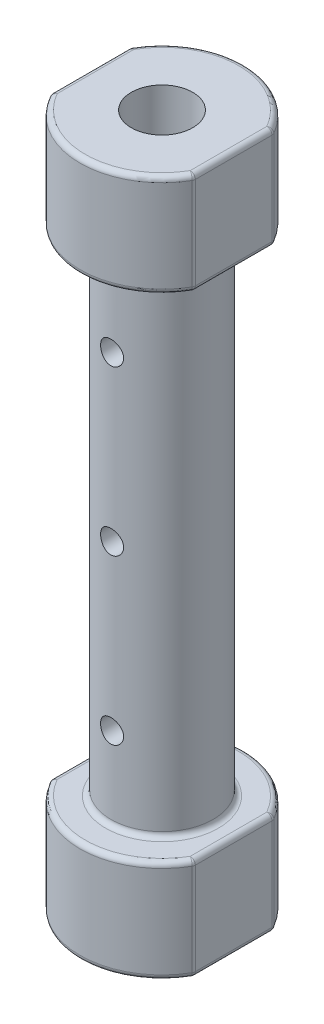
ISO-10303-21;
HEADER;
FILE_DESCRIPTION(('STEP AP214'),'2;1');
FILE_NAME('part.step','',(''),(''),'','','');
FILE_SCHEMA(('AUTOMOTIVE_DESIGN { 1 0 10303 214 1 1 1 1 }'));
ENDSEC;
DATA;
#1=APPLICATION_CONTEXT('core data for automotive mechanical design processes');
#2=APPLICATION_PROTOCOL_DEFINITION('international standard','automotive_design',2000,#1);
#3=PRODUCT_CONTEXT('',#1,'mechanical');
#4=PRODUCT('Part','Part','',(#3));
#5=PRODUCT_RELATED_PRODUCT_CATEGORY('part','',(#4));
#6=PRODUCT_DEFINITION_FORMATION('','',#4);
#7=PRODUCT_DEFINITION_CONTEXT('part definition',#1,'design');
#8=PRODUCT_DEFINITION('design','',#6,#7);
#9=PRODUCT_DEFINITION_SHAPE('','',#8);
#10=(LENGTH_UNIT() NAMED_UNIT(*) SI_UNIT(.MILLI.,.METRE.));
#11=(NAMED_UNIT(*) PLANE_ANGLE_UNIT() SI_UNIT($,.RADIAN.));
#12=(NAMED_UNIT(*) SI_UNIT($,.STERADIAN.) SOLID_ANGLE_UNIT());
#13=UNCERTAINTY_MEASURE_WITH_UNIT(LENGTH_MEASURE(1.E-05),#10,'distance_accuracy_value','');
#14=(GEOMETRIC_REPRESENTATION_CONTEXT(3) GLOBAL_UNCERTAINTY_ASSIGNED_CONTEXT((#13)) GLOBAL_UNIT_ASSIGNED_CONTEXT((#10,
#11,#12)) REPRESENTATION_CONTEXT('',''));
#15=CARTESIAN_POINT('',(0.,0.,0.));
#16=DIRECTION('',(0.,0.,1.));
#17=DIRECTION('',(1.,0.,0.));
#18=AXIS2_PLACEMENT_3D('',#15,#16,#17);
#19=CARTESIAN_POINT('',(0.,53.975,0.));
#20=DIRECTION('',(0.,-1.,0.));
#21=DIRECTION('',(0.,0.,-1.));
#22=AXIS2_PLACEMENT_3D('',#19,#20,#21);
#23=CYLINDRICAL_SURFACE('',#22,12.7);
#24=DIRECTION('',(0.,-1.,0.));
#25=VECTOR('',#24,1.);
#26=CARTESIAN_POINT('',(11.0066666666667,53.975,-6.33587317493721));
#27=LINE('',#26,#25);
#28=CARTESIAN_POINT('',(11.0066666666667,53.18125,-6.33587317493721));
#29=VERTEX_POINT('',#28);
#30=CARTESIAN_POINT('',(11.0066666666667,38.89375,-6.33587317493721));
#31=VERTEX_POINT('',#30);
#32=EDGE_CURVE('E396',#29,#31,#27,.T.);
#33=ORIENTED_EDGE('',*,*,#32,.T.);
#34=CARTESIAN_POINT('',(0.,38.89375,0.));
#35=DIRECTION('',(0.,1.,0.));
#36=DIRECTION('',(0.,0.,1.));
#37=AXIS2_PLACEMENT_3D('',#34,#35,#36);
#38=CIRCLE('',#37,12.7);
#39=CARTESIAN_POINT('',(-11.0066666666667,38.89375,-6.33587317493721));
#40=VERTEX_POINT('',#39);
#41=EDGE_CURVE('E399',#31,#40,#38,.T.);
#42=ORIENTED_EDGE('',*,*,#41,.T.);
#43=DIRECTION('',(0.,-1.,0.));
#44=VECTOR('',#43,1.);
#45=CARTESIAN_POINT('',(-11.0066666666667,53.975,-6.33587317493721));
#46=LINE('',#45,#44);
#47=CARTESIAN_POINT('',(-11.0066666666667,53.18125,-6.33587317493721));
#48=VERTEX_POINT('',#47);
#49=EDGE_CURVE('E394',#40,#48,#46,.F.);
#50=ORIENTED_EDGE('',*,*,#49,.T.);
#51=CARTESIAN_POINT('',(0.,53.18125,0.));
#52=DIRECTION('',(0.,1.,0.));
#53=DIRECTION('',(0.,0.,1.));
#54=AXIS2_PLACEMENT_3D('',#51,#52,#53);
#55=CIRCLE('',#54,12.7);
#56=EDGE_CURVE('E380',#48,#29,#55,.F.);
#57=ORIENTED_EDGE('',*,*,#56,.T.);
#58=EDGE_LOOP('',(#33,#42,#50,#57));
#59=FACE_BOUND('',#58,.T.);
#60=ADVANCED_FACE('F34',(#59),#23,.T.);
#61=CARTESIAN_POINT('',(0.,-53.975,0.));
#62=DIRECTION('',(0.,1.,0.));
#63=DIRECTION('',(0.,0.,1.));
#64=AXIS2_PLACEMENT_3D('',#61,#62,#63);
#65=CYLINDRICAL_SURFACE('',#64,12.7);
#66=DIRECTION('',(0.,1.,0.));
#67=VECTOR('',#66,1.);
#68=CARTESIAN_POINT('',(11.0066666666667,-53.975,6.33587317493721));
#69=LINE('',#68,#67);
#70=CARTESIAN_POINT('',(11.0066666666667,-53.18125,6.33587317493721));
#71=VERTEX_POINT('',#70);
#72=CARTESIAN_POINT('',(11.0066666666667,-38.89375,6.33587317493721));
#73=VERTEX_POINT('',#72);
#74=EDGE_CURVE('E466',#71,#73,#69,.T.);
#75=ORIENTED_EDGE('',*,*,#74,.T.);
#76=CARTESIAN_POINT('',(0.,-38.89375,0.));
#77=DIRECTION('',(0.,-1.,0.));
#78=DIRECTION('',(0.,0.,-1.));
#79=AXIS2_PLACEMENT_3D('',#76,#77,#78);
#80=CIRCLE('',#79,12.7);
#81=CARTESIAN_POINT('',(-11.0066666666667,-38.89375,6.33587317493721));
#82=VERTEX_POINT('',#81);
#83=EDGE_CURVE('E469',#73,#82,#80,.T.);
#84=ORIENTED_EDGE('',*,*,#83,.T.);
#85=DIRECTION('',(0.,1.,0.));
#86=VECTOR('',#85,1.);
#87=CARTESIAN_POINT('',(-11.0066666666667,-53.975,6.33587317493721));
#88=LINE('',#87,#86);
#89=CARTESIAN_POINT('',(-11.0066666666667,-53.18125,6.33587317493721));
#90=VERTEX_POINT('',#89);
#91=EDGE_CURVE('E464',#82,#90,#88,.F.);
#92=ORIENTED_EDGE('',*,*,#91,.T.);
#93=CARTESIAN_POINT('',(0.,-53.18125,0.));
#94=DIRECTION('',(0.,-1.,0.));
#95=DIRECTION('',(0.,0.,-1.));
#96=AXIS2_PLACEMENT_3D('',#93,#94,#95);
#97=CIRCLE('',#96,12.7);
#98=EDGE_CURVE('E462',#90,#71,#97,.F.);
#99=ORIENTED_EDGE('',*,*,#98,.T.);
#100=EDGE_LOOP('',(#75,#84,#92,#99));
#101=FACE_BOUND('',#100,.T.);
#102=ADVANCED_FACE('F514',(#101),#65,.T.);
#103=CARTESIAN_POINT('',(0.,38.1,0.));
#104=DIRECTION('',(0.,-1.,0.));
#105=DIRECTION('',(0.,0.,-1.));
#106=AXIS2_PLACEMENT_3D('',#103,#104,#105);
#107=CYLINDRICAL_SURFACE('',#106,7.9375);
#108=CARTESIAN_POINT('',(0.,37.30625,0.));
#109=DIRECTION('',(0.,1.,0.));
#110=DIRECTION('',(0.,0.,1.));
#111=AXIS2_PLACEMENT_3D('',#108,#109,#110);
#112=CIRCLE('',#111,7.9375);
#113=CARTESIAN_POINT('',(0.,37.30625,7.9375));
#114=VERTEX_POINT('',#113);
#115=EDGE_CURVE('E432',#114,#114,#112,.F.);
#116=ORIENTED_EDGE('',*,*,#115,.T.);
#117=EDGE_LOOP('',(#116));
#118=FACE_BOUND('',#117,.T.);
#119=CARTESIAN_POINT('',(0.,-37.30625,0.));
#120=DIRECTION('',(0.,-1.,0.));
#121=DIRECTION('',(0.,0.,-1.));
#122=AXIS2_PLACEMENT_3D('',#119,#120,#121);
#123=CIRCLE('',#122,7.9375);
#124=CARTESIAN_POINT('',(0.,-37.30625,-7.9375));
#125=VERTEX_POINT('',#124);
#126=EDGE_CURVE('E429',#125,#125,#123,.F.);
#127=ORIENTED_EDGE('',*,*,#126,.T.);
#128=EDGE_LOOP('',(#127));
#129=FACE_BOUND('',#128,.T.);
#130=CARTESIAN_POINT('',(0.,23.613999,7.9375));
#131=CARTESIAN_POINT('',(-0.0989840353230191,23.6140022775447,7.93749818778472));
#132=CARTESIAN_POINT('',(-0.198007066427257,23.6222556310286,7.93562969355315));
#133=CARTESIAN_POINT('',(-0.393235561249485,23.6550138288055,7.92835647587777));
#134=CARTESIAN_POINT('',(-0.489439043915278,23.6795298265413,7.92294932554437));
#135=CARTESIAN_POINT('',(-0.67617919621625,23.7440027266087,7.90920021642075));
#136=CARTESIAN_POINT('',(-0.766721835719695,23.7839430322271,7.90086141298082));
#137=CARTESIAN_POINT('',(-0.939818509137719,23.8780769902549,7.88214669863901));
#138=CARTESIAN_POINT('',(-1.02237265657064,23.9322704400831,7.87177081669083));
#139=CARTESIAN_POINT('',(-1.17854848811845,24.0543425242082,7.84992033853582));
#140=CARTESIAN_POINT('',(-1.25201564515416,24.1224163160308,7.83843146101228));
#141=CARTESIAN_POINT('',(-1.38659152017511,24.26989796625,7.81574936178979));
#142=CARTESIAN_POINT('',(-1.4476990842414,24.3493068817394,7.80455616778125));
#143=CARTESIAN_POINT('',(-1.5565114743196,24.5183581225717,7.78359139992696));
#144=CARTESIAN_POINT('',(-1.60405020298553,24.6081098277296,7.7738380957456));
#145=CARTESIAN_POINT('',(-1.68330953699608,24.7945841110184,7.75706306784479));
#146=CARTESIAN_POINT('',(-1.71503215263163,24.8913058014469,7.75004099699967));
#147=CARTESIAN_POINT('',(-1.76124491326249,25.0872936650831,7.73966922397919));
#148=CARTESIAN_POINT('',(-1.77600948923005,25.1864919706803,7.73626110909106));
#149=CARTESIAN_POINT('',(-1.78874066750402,25.3860116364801,7.73332781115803));
#150=CARTESIAN_POINT('',(-1.7867094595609,25.4863328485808,7.73380212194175));
#151=CARTESIAN_POINT('',(-1.76612721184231,25.6831986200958,7.73852727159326));
#152=CARTESIAN_POINT('',(-1.74789650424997,25.7797786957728,7.74270487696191));
#153=CARTESIAN_POINT('',(-1.69594092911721,25.9684733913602,7.75424994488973));
#154=CARTESIAN_POINT('',(-1.66221514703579,26.0605877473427,7.76161759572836));
#155=CARTESIAN_POINT('',(-1.57993673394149,26.2386287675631,7.77878381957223));
#156=CARTESIAN_POINT('',(-1.53126226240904,26.324497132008,7.78860223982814));
#157=CARTESIAN_POINT('',(-1.42055373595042,26.4869651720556,7.80955173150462));
#158=CARTESIAN_POINT('',(-1.35851775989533,26.5635635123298,7.82068299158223));
#159=CARTESIAN_POINT('',(-1.22115844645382,26.7071598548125,7.84331706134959));
#160=CARTESIAN_POINT('',(-1.14556309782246,26.7738975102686,7.85482253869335));
#161=CARTESIAN_POINT('',(-0.984121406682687,26.8937918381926,7.87667671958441));
#162=CARTESIAN_POINT('',(-0.898274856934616,26.9469482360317,7.88702539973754));
#163=CARTESIAN_POINT('',(-0.718439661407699,27.0382413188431,7.9054366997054));
#164=CARTESIAN_POINT('',(-0.624432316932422,27.0763423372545,7.91349387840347));
#165=CARTESIAN_POINT('',(-0.43112754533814,27.1361335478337,7.92637412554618));
#166=CARTESIAN_POINT('',(-0.331830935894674,27.1578262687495,7.93119769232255));
#167=CARTESIAN_POINT('',(-0.132998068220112,27.1838028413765,7.93699575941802));
#168=CARTESIAN_POINT('',(-0.0335104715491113,27.1884421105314,7.93804882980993));
#169=CARTESIAN_POINT('',(0.164818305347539,27.1811456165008,7.93640811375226));
#170=CARTESIAN_POINT('',(0.263659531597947,27.1692110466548,7.93371459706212));
#171=CARTESIAN_POINT('',(0.456701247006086,27.1294000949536,7.92493308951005));
#172=CARTESIAN_POINT('',(0.550942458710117,27.1017115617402,7.91888511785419));
#173=CARTESIAN_POINT('',(0.733442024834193,27.0313883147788,7.90407230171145));
#174=CARTESIAN_POINT('',(0.82169984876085,26.9887522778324,7.89530721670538));
#175=CARTESIAN_POINT('',(0.991186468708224,26.8890137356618,7.87583954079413));
#176=CARTESIAN_POINT('',(1.07229030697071,26.8317042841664,7.86510991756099));
#177=CARTESIAN_POINT('',(1.22385716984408,26.7045166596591,7.84295590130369));
#178=CARTESIAN_POINT('',(1.29431872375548,26.6346367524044,7.83153141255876));
#179=CARTESIAN_POINT('',(1.42401763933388,26.4826567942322,7.80900164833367));
#180=CARTESIAN_POINT('',(1.48300821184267,26.4003442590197,7.79790700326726));
#181=CARTESIAN_POINT('',(1.5863308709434,26.2267725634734,7.77754748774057));
#182=CARTESIAN_POINT('',(1.63066360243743,26.1355137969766,7.76828253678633));
#183=CARTESIAN_POINT('',(1.70310463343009,25.9471350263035,7.75272304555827));
#184=CARTESIAN_POINT('',(1.73130592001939,25.8500522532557,7.74641151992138));
#185=CARTESIAN_POINT('',(1.77095178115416,25.6523644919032,7.73744510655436));
#186=CARTESIAN_POINT('',(1.78239921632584,25.5517601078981,7.73478959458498));
#187=CARTESIAN_POINT('',(1.78808521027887,25.352377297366,7.73347682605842));
#188=CARTESIAN_POINT('',(1.78271560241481,25.2536104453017,7.7347285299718));
#189=CARTESIAN_POINT('',(1.75579987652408,25.0584279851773,7.74088238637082));
#190=CARTESIAN_POINT('',(1.73425397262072,24.9620123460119,7.74578449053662));
#191=CARTESIAN_POINT('',(1.67579150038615,24.7746023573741,7.75864116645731));
#192=CARTESIAN_POINT('',(1.63893511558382,24.6835883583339,7.76658377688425));
#193=CARTESIAN_POINT('',(1.55094846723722,24.5089785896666,7.78463057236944));
#194=CARTESIAN_POINT('',(1.49981661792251,24.4253836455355,7.79473499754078));
#195=CARTESIAN_POINT('',(1.38344451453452,24.2660604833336,7.81623650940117));
#196=CARTESIAN_POINT('',(1.31792638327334,24.1905382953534,7.82765658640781));
#197=CARTESIAN_POINT('',(1.17520065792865,24.0514320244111,7.85035165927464));
#198=CARTESIAN_POINT('',(1.09799035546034,23.987850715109,7.86162662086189));
#199=CARTESIAN_POINT('',(0.932777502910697,23.8735812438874,7.88294730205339));
#200=CARTESIAN_POINT('',(0.844639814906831,23.8230846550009,7.89297374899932));
#201=CARTESIAN_POINT('',(0.660918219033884,23.7377035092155,7.91047271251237));
#202=CARTESIAN_POINT('',(0.565340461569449,23.7028062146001,7.9179473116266));
#203=CARTESIAN_POINT('',(0.391428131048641,23.6556387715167,7.92820959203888));
#204=CARTESIAN_POINT('',(0.314015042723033,23.6400543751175,7.93167147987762));
#205=CARTESIAN_POINT('',(0.157742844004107,23.6192334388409,7.93631734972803));
#206=CARTESIAN_POINT('',(0.0788838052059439,23.6139963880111,7.93750144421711));
#207=CARTESIAN_POINT('',(0.,23.613999,7.9375));
#208=B_SPLINE_CURVE_WITH_KNOTS('',3,(#130,#131,#132,#133,#134,#135,#136,#137,#138,#139,#140,
#141,#142,#143,#144,#145,#146,#147,#148,#149,#150,#151,#152,#153,#154,#155,#156,#157,#158,#159,
#160,#161,#162,#163,#164,#165,#166,#167,#168,#169,#170,#171,#172,#173,#174,#175,#176,#177,#178,
#179,#180,#181,#182,#183,#184,#185,#186,#187,#188,#189,#190,#191,#192,#193,#194,#195,#196,#197,
#198,#199,#200,#201,#202,#203,#204,#205,#206,#207),.UNSPECIFIED.,.T.,.F.,(4,2,2,2,2,2,2,2,2,2,2,
2,2,2,2,2,2,2,2,2,2,2,2,2,2,2,2,2,2,2,2,2,2,2,2,2,2,2,4),(0.,0.296663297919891,
0.593530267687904,0.890078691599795,1.18662290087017,1.48766629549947,1.7887377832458,
2.09335048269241,2.3979244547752,2.69749681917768,2.99703012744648,3.29076903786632,
3.58452528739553,3.88074238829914,4.17700210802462,4.4800536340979,4.78311128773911,
5.08688264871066,5.39060718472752,5.68796459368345,5.98530059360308,6.27916333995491,
6.57305210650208,6.87133900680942,7.16966709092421,7.47383657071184,7.77799266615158,
8.08037736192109,8.38271042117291,8.6780520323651,8.97338973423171,9.26757732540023,
9.56179760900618,9.8622987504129,10.1628696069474,10.4676199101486,10.7721209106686,
11.0085538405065,11.2449750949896),.UNSPECIFIED.);
#209=CARTESIAN_POINT('',(0.,23.613999,7.9375));
#210=VERTEX_POINT('',#209);
#211=EDGE_CURVE('E717',#210,#210,#208,.T.);
#212=ORIENTED_EDGE('',*,*,#211,.T.);
#213=EDGE_LOOP('',(#212));
#214=FACE_BOUND('',#213,.T.);
#215=CARTESIAN_POINT('',(0.,-1.78600099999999,7.9375));
#216=CARTESIAN_POINT('',(-0.0989840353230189,-1.78599772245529,7.93749818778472));
#217=CARTESIAN_POINT('',(-0.198007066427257,-1.7777443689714,7.93562969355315));
#218=CARTESIAN_POINT('',(-0.393235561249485,-1.74498617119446,7.92835647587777));
#219=CARTESIAN_POINT('',(-0.489439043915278,-1.72047017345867,7.92294932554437));
#220=CARTESIAN_POINT('',(-0.67617919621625,-1.65599727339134,7.90920021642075));
#221=CARTESIAN_POINT('',(-0.766721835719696,-1.61605696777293,7.90086141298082));
#222=CARTESIAN_POINT('',(-0.939818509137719,-1.5219230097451,7.88214669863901));
#223=CARTESIAN_POINT('',(-1.02237265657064,-1.46772955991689,7.87177081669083));
#224=CARTESIAN_POINT('',(-1.17854848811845,-1.34565747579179,7.84992033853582));
#225=CARTESIAN_POINT('',(-1.25201564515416,-1.27758368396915,7.83843146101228));
#226=CARTESIAN_POINT('',(-1.38659152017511,-1.13010203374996,7.81574936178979));
#227=CARTESIAN_POINT('',(-1.4476990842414,-1.05069311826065,7.80455616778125));
#228=CARTESIAN_POINT('',(-1.5565114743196,-0.88164187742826,7.78359139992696));
#229=CARTESIAN_POINT('',(-1.60405020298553,-0.791890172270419,7.7738380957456));
#230=CARTESIAN_POINT('',(-1.68330953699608,-0.605415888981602,7.75706306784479));
#231=CARTESIAN_POINT('',(-1.71503215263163,-0.508694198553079,7.75004099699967));
#232=CARTESIAN_POINT('',(-1.76124491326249,-0.312706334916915,7.73966922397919));
#233=CARTESIAN_POINT('',(-1.77600948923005,-0.213508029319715,7.73626110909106));
#234=CARTESIAN_POINT('',(-1.78874066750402,-0.0139883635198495,7.73332781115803));
#235=CARTESIAN_POINT('',(-1.7867094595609,0.086332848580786,7.73380212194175));
#236=CARTESIAN_POINT('',(-1.76612721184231,0.283198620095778,7.73852727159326));
#237=CARTESIAN_POINT('',(-1.74789650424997,0.379778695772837,7.74270487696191));
#238=CARTESIAN_POINT('',(-1.69594092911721,0.568473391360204,7.75424994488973));
#239=CARTESIAN_POINT('',(-1.66221514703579,0.66058774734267,7.76161759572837));
#240=CARTESIAN_POINT('',(-1.57993673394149,0.838628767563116,7.77878381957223));
#241=CARTESIAN_POINT('',(-1.53126226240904,0.924497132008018,7.78860223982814));
#242=CARTESIAN_POINT('',(-1.42055373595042,1.08696517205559,7.80955173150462));
#243=CARTESIAN_POINT('',(-1.35851775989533,1.16356351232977,7.82068299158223));
#244=CARTESIAN_POINT('',(-1.22115844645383,1.30715985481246,7.84331706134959));
#245=CARTESIAN_POINT('',(-1.14556309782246,1.37389751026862,7.85482253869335));
#246=CARTESIAN_POINT('',(-0.984121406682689,1.49379183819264,7.87667671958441));
#247=CARTESIAN_POINT('',(-0.898274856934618,1.54694823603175,7.88702539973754));
#248=CARTESIAN_POINT('',(-0.7184396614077,1.6382413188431,7.9054366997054));
#249=CARTESIAN_POINT('',(-0.624432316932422,1.6763423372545,7.91349387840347));
#250=CARTESIAN_POINT('',(-0.431127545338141,1.73613354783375,7.92637412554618));
#251=CARTESIAN_POINT('',(-0.331830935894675,1.75782626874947,7.93119769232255));
#252=CARTESIAN_POINT('',(-0.132998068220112,1.78380284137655,7.93699575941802));
#253=CARTESIAN_POINT('',(-0.0335104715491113,1.78844211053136,7.93804882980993));
#254=CARTESIAN_POINT('',(0.164818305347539,1.78114561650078,7.93640811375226));
#255=CARTESIAN_POINT('',(0.263659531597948,1.76921104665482,7.93371459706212));
#256=CARTESIAN_POINT('',(0.456701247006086,1.72940009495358,7.92493308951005));
#257=CARTESIAN_POINT('',(0.550942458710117,1.70171156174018,7.91888511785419));
#258=CARTESIAN_POINT('',(0.733442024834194,1.63138831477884,7.90407230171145));
#259=CARTESIAN_POINT('',(0.821699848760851,1.5887522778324,7.89530721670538));
#260=CARTESIAN_POINT('',(0.991186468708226,1.48901373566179,7.87583954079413));
#261=CARTESIAN_POINT('',(1.07229030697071,1.43170428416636,7.86510991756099));
#262=CARTESIAN_POINT('',(1.22385716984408,1.30451665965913,7.84295590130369));
#263=CARTESIAN_POINT('',(1.29431872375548,1.23463675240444,7.83153141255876));
#264=CARTESIAN_POINT('',(1.42401763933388,1.08265679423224,7.80900164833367));
#265=CARTESIAN_POINT('',(1.48300821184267,1.00034425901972,7.79790700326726));
#266=CARTESIAN_POINT('',(1.5863308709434,0.826772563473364,7.77754748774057));
#267=CARTESIAN_POINT('',(1.63066360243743,0.735513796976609,7.76828253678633));
#268=CARTESIAN_POINT('',(1.70310463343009,0.547135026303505,7.75272304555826));
#269=CARTESIAN_POINT('',(1.73130592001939,0.450052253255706,7.74641151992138));
#270=CARTESIAN_POINT('',(1.77095178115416,0.25236449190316,7.73744510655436));
#271=CARTESIAN_POINT('',(1.78239921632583,0.151760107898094,7.73478959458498));
#272=CARTESIAN_POINT('',(1.78808521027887,-0.0476227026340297,7.73347682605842));
#273=CARTESIAN_POINT('',(1.78271560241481,-0.146389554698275,7.7347285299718));
#274=CARTESIAN_POINT('',(1.75579987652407,-0.341572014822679,7.74088238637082));
#275=CARTESIAN_POINT('',(1.73425397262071,-0.437987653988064,7.74578449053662));
#276=CARTESIAN_POINT('',(1.67579150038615,-0.625397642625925,7.75864116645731));
#277=CARTESIAN_POINT('',(1.63893511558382,-0.71641164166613,7.76658377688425));
#278=CARTESIAN_POINT('',(1.55094846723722,-0.891021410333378,7.78463057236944));
#279=CARTESIAN_POINT('',(1.49981661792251,-0.974616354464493,7.79473499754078));
#280=CARTESIAN_POINT('',(1.38344451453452,-1.13393951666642,7.81623650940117));
#281=CARTESIAN_POINT('',(1.31792638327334,-1.20946170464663,7.82765658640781));
#282=CARTESIAN_POINT('',(1.17520065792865,-1.34856797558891,7.85035165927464));
#283=CARTESIAN_POINT('',(1.09799035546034,-1.41214928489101,7.86162662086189));
#284=CARTESIAN_POINT('',(0.932777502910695,-1.52641875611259,7.88294730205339));
#285=CARTESIAN_POINT('',(0.84463981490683,-1.57691534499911,7.89297374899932));
#286=CARTESIAN_POINT('',(0.660918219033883,-1.66229649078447,7.91047271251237));
#287=CARTESIAN_POINT('',(0.565340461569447,-1.69719378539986,7.9179473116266));
#288=CARTESIAN_POINT('',(0.391428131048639,-1.74436122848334,7.92820959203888));
#289=CARTESIAN_POINT('',(0.314015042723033,-1.75994562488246,7.93167147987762));
#290=CARTESIAN_POINT('',(0.157742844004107,-1.78076656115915,7.93631734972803));
#291=CARTESIAN_POINT('',(0.0788838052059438,-1.78600361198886,7.93750144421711));
#292=CARTESIAN_POINT('',(0.,-1.78600099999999,7.9375));
#293=B_SPLINE_CURVE_WITH_KNOTS('',3,(#215,#216,#217,#218,#219,#220,#221,#222,#223,#224,#225,
#226,#227,#228,#229,#230,#231,#232,#233,#234,#235,#236,#237,#238,#239,#240,#241,#242,#243,#244,
#245,#246,#247,#248,#249,#250,#251,#252,#253,#254,#255,#256,#257,#258,#259,#260,#261,#262,#263,
#264,#265,#266,#267,#268,#269,#270,#271,#272,#273,#274,#275,#276,#277,#278,#279,#280,#281,#282,
#283,#284,#285,#286,#287,#288,#289,#290,#291,#292),.UNSPECIFIED.,.T.,.F.,(4,2,2,2,2,2,2,2,2,2,2,
2,2,2,2,2,2,2,2,2,2,2,2,2,2,2,2,2,2,2,2,2,2,2,2,2,2,2,4),(0.,0.296663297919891,
0.593530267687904,0.890078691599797,1.18662290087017,1.48766629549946,1.7887377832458,
2.09335048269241,2.3979244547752,2.69749681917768,2.99703012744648,3.29076903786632,
3.58452528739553,3.88074238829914,4.17700210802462,4.48005363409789,4.78311128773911,
5.08688264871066,5.39060718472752,5.68796459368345,5.98530059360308,6.27916333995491,
6.57305210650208,6.87133900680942,7.16966709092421,7.47383657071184,7.77799266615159,
8.08037736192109,8.38271042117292,8.67805203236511,8.97338973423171,9.26757732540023,
9.56179760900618,9.8622987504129,10.1628696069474,10.4676199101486,10.7721209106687,
11.0085538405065,11.2449750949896),.UNSPECIFIED.);
#294=CARTESIAN_POINT('',(0.,-1.78600099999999,7.9375));
#295=VERTEX_POINT('',#294);
#296=EDGE_CURVE('E721',#295,#295,#293,.T.);
#297=ORIENTED_EDGE('',*,*,#296,.T.);
#298=EDGE_LOOP('',(#297));
#299=FACE_BOUND('',#298,.T.);
#300=CARTESIAN_POINT('',(0.,-27.186001,7.9375));
#301=CARTESIAN_POINT('',(-0.098984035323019,-27.1859977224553,7.93749818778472));
#302=CARTESIAN_POINT('',(-0.198007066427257,-27.1777443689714,7.93562969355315));
#303=CARTESIAN_POINT('',(-0.393235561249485,-27.1449861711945,7.92835647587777));
#304=CARTESIAN_POINT('',(-0.489439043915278,-27.1204701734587,7.92294932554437));
#305=CARTESIAN_POINT('',(-0.67617919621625,-27.0559972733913,7.90920021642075));
#306=CARTESIAN_POINT('',(-0.766721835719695,-27.0160569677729,7.90086141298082));
#307=CARTESIAN_POINT('',(-0.939818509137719,-26.9219230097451,7.88214669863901));
#308=CARTESIAN_POINT('',(-1.02237265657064,-26.8677295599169,7.87177081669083));
#309=CARTESIAN_POINT('',(-1.17854848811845,-26.7456574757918,7.84992033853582));
#310=CARTESIAN_POINT('',(-1.25201564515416,-26.6775836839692,7.83843146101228));
#311=CARTESIAN_POINT('',(-1.38659152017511,-26.53010203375,7.81574936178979));
#312=CARTESIAN_POINT('',(-1.4476990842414,-26.4506931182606,7.80455616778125));
#313=CARTESIAN_POINT('',(-1.5565114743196,-26.2816418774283,7.78359139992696));
#314=CARTESIAN_POINT('',(-1.60405020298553,-26.1918901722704,7.7738380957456));
#315=CARTESIAN_POINT('',(-1.68330953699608,-26.0054158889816,7.75706306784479));
#316=CARTESIAN_POINT('',(-1.71503215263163,-25.9086941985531,7.75004099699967));
#317=CARTESIAN_POINT('',(-1.76124491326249,-25.7127063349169,7.73966922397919));
#318=CARTESIAN_POINT('',(-1.77600948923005,-25.6135080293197,7.73626110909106));
#319=CARTESIAN_POINT('',(-1.78874066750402,-25.4139883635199,7.73332781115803));
#320=CARTESIAN_POINT('',(-1.7867094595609,-25.3136671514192,7.73380212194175));
#321=CARTESIAN_POINT('',(-1.76612721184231,-25.1168013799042,7.73852727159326));
#322=CARTESIAN_POINT('',(-1.74789650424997,-25.0202213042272,7.74270487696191));
#323=CARTESIAN_POINT('',(-1.69594092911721,-24.8315266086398,7.75424994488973));
#324=CARTESIAN_POINT('',(-1.66221514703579,-24.7394122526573,7.76161759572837));
#325=CARTESIAN_POINT('',(-1.57993673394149,-24.5613712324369,7.77878381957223));
#326=CARTESIAN_POINT('',(-1.53126226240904,-24.475502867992,7.78860223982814));
#327=CARTESIAN_POINT('',(-1.42055373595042,-24.3130348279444,7.80955173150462));
#328=CARTESIAN_POINT('',(-1.35851775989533,-24.2364364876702,7.82068299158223));
#329=CARTESIAN_POINT('',(-1.22115844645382,-24.0928401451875,7.84331706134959));
#330=CARTESIAN_POINT('',(-1.14556309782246,-24.0261024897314,7.85482253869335));
#331=CARTESIAN_POINT('',(-0.984121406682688,-23.9062081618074,7.87667671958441));
#332=CARTESIAN_POINT('',(-0.898274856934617,-23.8530517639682,7.88702539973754));
#333=CARTESIAN_POINT('',(-0.718439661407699,-23.7617586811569,7.9054366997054));
#334=CARTESIAN_POINT('',(-0.624432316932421,-23.7236576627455,7.91349387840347));
#335=CARTESIAN_POINT('',(-0.431127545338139,-23.6638664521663,7.92637412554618));
#336=CARTESIAN_POINT('',(-0.331830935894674,-23.6421737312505,7.93119769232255));
#337=CARTESIAN_POINT('',(-0.132998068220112,-23.6161971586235,7.93699575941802));
#338=CARTESIAN_POINT('',(-0.0335104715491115,-23.6115578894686,7.93804882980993));
#339=CARTESIAN_POINT('',(0.164818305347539,-23.6188543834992,7.93640811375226));
#340=CARTESIAN_POINT('',(0.263659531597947,-23.6307889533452,7.93371459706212));
#341=CARTESIAN_POINT('',(0.456701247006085,-23.6705999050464,7.92493308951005));
#342=CARTESIAN_POINT('',(0.550942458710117,-23.6982884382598,7.91888511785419));
#343=CARTESIAN_POINT('',(0.733442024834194,-23.7686116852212,7.90407230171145));
#344=CARTESIAN_POINT('',(0.82169984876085,-23.8112477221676,7.89530721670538));
#345=CARTESIAN_POINT('',(0.991186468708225,-23.9109862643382,7.87583954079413));
#346=CARTESIAN_POINT('',(1.07229030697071,-23.9682957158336,7.86510991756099));
#347=CARTESIAN_POINT('',(1.22385716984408,-24.0954833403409,7.84295590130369));
#348=CARTESIAN_POINT('',(1.29431872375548,-24.1653632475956,7.83153141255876));
#349=CARTESIAN_POINT('',(1.42401763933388,-24.3173432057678,7.80900164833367));
#350=CARTESIAN_POINT('',(1.48300821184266,-24.3996557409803,7.79790700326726));
#351=CARTESIAN_POINT('',(1.58633087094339,-24.5732274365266,7.77754748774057));
#352=CARTESIAN_POINT('',(1.63066360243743,-24.6644862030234,7.76828253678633));
#353=CARTESIAN_POINT('',(1.70310463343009,-24.8528649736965,7.75272304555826));
#354=CARTESIAN_POINT('',(1.73130592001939,-24.9499477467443,7.74641151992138));
#355=CARTESIAN_POINT('',(1.77095178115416,-25.1476355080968,7.73744510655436));
#356=CARTESIAN_POINT('',(1.78239921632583,-25.2482398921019,7.73478959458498));
#357=CARTESIAN_POINT('',(1.78808521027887,-25.447622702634,7.73347682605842));
#358=CARTESIAN_POINT('',(1.78271560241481,-25.5463895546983,7.7347285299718));
#359=CARTESIAN_POINT('',(1.75579987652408,-25.7415720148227,7.74088238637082));
#360=CARTESIAN_POINT('',(1.73425397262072,-25.8379876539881,7.74578449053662));
#361=CARTESIAN_POINT('',(1.67579150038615,-26.0253976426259,7.75864116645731));
#362=CARTESIAN_POINT('',(1.63893511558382,-26.1164116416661,7.76658377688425));
#363=CARTESIAN_POINT('',(1.55094846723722,-26.2910214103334,7.78463057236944));
#364=CARTESIAN_POINT('',(1.49981661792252,-26.3746163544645,7.79473499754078));
#365=CARTESIAN_POINT('',(1.38344451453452,-26.5339395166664,7.81623650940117));
#366=CARTESIAN_POINT('',(1.31792638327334,-26.6094617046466,7.82765658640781));
#367=CARTESIAN_POINT('',(1.17520065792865,-26.7485679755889,7.85035165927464));
#368=CARTESIAN_POINT('',(1.09799035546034,-26.812149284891,7.86162662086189));
#369=CARTESIAN_POINT('',(0.932777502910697,-26.9264187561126,7.88294730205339));
#370=CARTESIAN_POINT('',(0.844639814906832,-26.9769153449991,7.89297374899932));
#371=CARTESIAN_POINT('',(0.660918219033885,-27.0622964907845,7.91047271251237));
#372=CARTESIAN_POINT('',(0.565340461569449,-27.0971937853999,7.9179473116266));
#373=CARTESIAN_POINT('',(0.39142813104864,-27.1443612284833,7.92820959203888));
#374=CARTESIAN_POINT('',(0.314015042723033,-27.1599456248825,7.93167147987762));
#375=CARTESIAN_POINT('',(0.157742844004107,-27.1807665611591,7.93631734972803));
#376=CARTESIAN_POINT('',(0.0788838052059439,-27.1860036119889,7.93750144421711));
#377=CARTESIAN_POINT('',(0.,-27.186001,7.9375));
#378=B_SPLINE_CURVE_WITH_KNOTS('',3,(#300,#301,#302,#303,#304,#305,#306,#307,#308,#309,#310,
#311,#312,#313,#314,#315,#316,#317,#318,#319,#320,#321,#322,#323,#324,#325,#326,#327,#328,#329,
#330,#331,#332,#333,#334,#335,#336,#337,#338,#339,#340,#341,#342,#343,#344,#345,#346,#347,#348,
#349,#350,#351,#352,#353,#354,#355,#356,#357,#358,#359,#360,#361,#362,#363,#364,#365,#366,#367,
#368,#369,#370,#371,#372,#373,#374,#375,#376,#377),.UNSPECIFIED.,.T.,.F.,(4,2,2,2,2,2,2,2,2,2,2,
2,2,2,2,2,2,2,2,2,2,2,2,2,2,2,2,2,2,2,2,2,2,2,2,2,2,2,4),(0.,0.296663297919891,
0.593530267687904,0.890078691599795,1.18662290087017,1.48766629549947,1.7887377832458,
2.09335048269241,2.3979244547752,2.69749681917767,2.99703012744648,3.29076903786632,
3.58452528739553,3.88074238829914,4.17700210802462,4.4800536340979,4.78311128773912,
5.08688264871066,5.39060718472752,5.68796459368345,5.98530059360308,6.27916333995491,
6.57305210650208,6.87133900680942,7.16966709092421,7.47383657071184,7.77799266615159,
8.08037736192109,8.38271042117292,8.6780520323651,8.97338973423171,9.26757732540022,
9.56179760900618,9.8622987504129,10.1628696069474,10.4676199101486,10.7721209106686,
11.0085538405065,11.2449750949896),.UNSPECIFIED.);
#379=CARTESIAN_POINT('',(0.,-27.186001,7.9375));
#380=VERTEX_POINT('',#379);
#381=EDGE_CURVE('E598',#380,#380,#378,.T.);
#382=ORIENTED_EDGE('',*,*,#381,.T.);
#383=EDGE_LOOP('',(#382));
#384=FACE_BOUND('',#383,.T.);
#385=ADVANCED_FACE('F548',(#118,#129,#214,#299,#384),#107,.T.);
#386=CARTESIAN_POINT('',(0.,38.1,0.));
#387=DIRECTION('',(0.,1.,0.));
#388=DIRECTION('',(0.,0.,1.));
#389=AXIS2_PLACEMENT_3D('',#386,#387,#388);
#390=PLANE('',#389);
#391=DIRECTION('',(0.,0.,-1.));
#392=VECTOR('',#391,1.);
#393=CARTESIAN_POINT('',(-10.31875,38.1,0.));
#394=LINE('',#393,#392);
#395=CARTESIAN_POINT('',(-10.31875,38.1,5.93988110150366));
#396=VERTEX_POINT('',#395);
#397=CARTESIAN_POINT('',(-10.31875,38.1,-5.93988110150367));
#398=VERTEX_POINT('',#397);
#399=EDGE_CURVE('E413',#396,#398,#394,.T.);
#400=ORIENTED_EDGE('',*,*,#399,.T.);
#401=CARTESIAN_POINT('',(0.,38.1,0.));
#402=DIRECTION('',(0.,1.,0.));
#403=DIRECTION('',(0.,0.,1.));
#404=AXIS2_PLACEMENT_3D('',#401,#402,#403);
#405=CIRCLE('',#404,11.90625);
#406=CARTESIAN_POINT('',(10.31875,38.1,-5.93988110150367));
#407=VERTEX_POINT('',#406);
#408=EDGE_CURVE('E418',#398,#407,#405,.F.);
#409=ORIENTED_EDGE('',*,*,#408,.T.);
#410=DIRECTION('',(0.,0.,1.));
#411=VECTOR('',#410,1.);
#412=CARTESIAN_POINT('',(10.31875,38.1,0.));
#413=LINE('',#412,#411);
#414=CARTESIAN_POINT('',(10.31875,38.1,5.93988110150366));
#415=VERTEX_POINT('',#414);
#416=EDGE_CURVE('E415',#407,#415,#413,.T.);
#417=ORIENTED_EDGE('',*,*,#416,.T.);
#418=CARTESIAN_POINT('',(0.,38.1,0.));
#419=DIRECTION('',(0.,1.,0.));
#420=DIRECTION('',(0.,0.,1.));
#421=AXIS2_PLACEMENT_3D('',#418,#419,#420);
#422=CIRCLE('',#421,11.90625);
#423=EDGE_CURVE('E411',#415,#396,#422,.F.);
#424=ORIENTED_EDGE('',*,*,#423,.T.);
#425=EDGE_LOOP('',(#400,#409,#417,#424));
#426=FACE_BOUND('',#425,.T.);
#427=CARTESIAN_POINT('',(0.,38.1,0.));
#428=DIRECTION('',(0.,1.,0.));
#429=DIRECTION('',(0.,0.,1.));
#430=AXIS2_PLACEMENT_3D('',#427,#428,#429);
#431=CIRCLE('',#430,8.73125);
#432=CARTESIAN_POINT('',(0.,38.1,8.73125));
#433=VERTEX_POINT('',#432);
#434=EDGE_CURVE('E408',#433,#433,#431,.T.);
#435=ORIENTED_EDGE('',*,*,#434,.T.);
#436=EDGE_LOOP('',(#435));
#437=FACE_BOUND('',#436,.T.);
#438=ADVANCED_FACE('F554',(#426,#437),#390,.F.);
#439=DIRECTION('',(0.,-1.,0.));
#440=VECTOR('',#439,1.);
#441=CARTESIAN_POINT('',(-11.0066666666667,53.975,6.33587317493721));
#442=LINE('',#441,#440);
#443=CARTESIAN_POINT('',(-11.0066666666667,53.18125,6.33587317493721));
#444=VERTEX_POINT('',#443);
#445=CARTESIAN_POINT('',(-11.0066666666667,38.89375,6.33587317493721));
#446=VERTEX_POINT('',#445);
#447=EDGE_CURVE('E403',#444,#446,#442,.T.);
#448=ORIENTED_EDGE('',*,*,#447,.T.);
#449=CARTESIAN_POINT('',(0.,38.89375,0.));
#450=DIRECTION('',(0.,1.,0.));
#451=DIRECTION('',(0.,0.,1.));
#452=AXIS2_PLACEMENT_3D('',#449,#450,#451);
#453=CIRCLE('',#452,12.7);
#454=CARTESIAN_POINT('',(11.0066666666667,38.89375,6.33587317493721));
#455=VERTEX_POINT('',#454);
#456=EDGE_CURVE('E406',#446,#455,#453,.T.);
#457=ORIENTED_EDGE('',*,*,#456,.T.);
#458=DIRECTION('',(0.,-1.,0.));
#459=VECTOR('',#458,1.);
#460=CARTESIAN_POINT('',(11.0066666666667,53.975,6.33587317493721));
#461=LINE('',#460,#459);
#462=CARTESIAN_POINT('',(11.0066666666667,53.18125,6.33587317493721));
#463=VERTEX_POINT('',#462);
#464=EDGE_CURVE('E233',#455,#463,#461,.F.);
#465=ORIENTED_EDGE('',*,*,#464,.T.);
#466=CARTESIAN_POINT('',(0.,53.18125,0.));
#467=DIRECTION('',(0.,1.,0.));
#468=DIRECTION('',(0.,0.,1.));
#469=AXIS2_PLACEMENT_3D('',#466,#467,#468);
#470=CIRCLE('',#469,12.7);
#471=EDGE_CURVE('E401',#463,#444,#470,.F.);
#472=ORIENTED_EDGE('',*,*,#471,.T.);
#473=EDGE_LOOP('',(#448,#457,#465,#472));
#474=FACE_BOUND('',#473,.T.);
#475=ADVANCED_FACE('F544',(#474),#23,.T.);
#476=CARTESIAN_POINT('',(0.,53.975,0.));
#477=DIRECTION('',(0.,1.,0.));
#478=DIRECTION('',(0.,0.,1.));
#479=AXIS2_PLACEMENT_3D('',#476,#477,#478);
#480=PLANE('',#479);
#481=DIRECTION('',(0.,0.,1.));
#482=VECTOR('',#481,1.);
#483=CARTESIAN_POINT('',(10.31875,53.975,-6.14836106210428));
#484=LINE('',#483,#482);
#485=CARTESIAN_POINT('',(10.31875,53.975,5.93988110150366));
#486=VERTEX_POINT('',#485);
#487=CARTESIAN_POINT('',(10.31875,53.975,-5.93988110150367));
#488=VERTEX_POINT('',#487);
#489=EDGE_CURVE('E381',#486,#488,#484,.F.);
#490=ORIENTED_EDGE('',*,*,#489,.T.);
#491=CARTESIAN_POINT('',(0.,53.975,0.));
#492=DIRECTION('',(0.,1.,0.));
#493=DIRECTION('',(0.,0.,1.));
#494=AXIS2_PLACEMENT_3D('',#491,#492,#493);
#495=CIRCLE('',#494,11.90625);
#496=CARTESIAN_POINT('',(-10.31875,53.975,-5.93988110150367));
#497=VERTEX_POINT('',#496);
#498=EDGE_CURVE('E374',#488,#497,#495,.T.);
#499=ORIENTED_EDGE('',*,*,#498,.T.);
#500=DIRECTION('',(0.,0.,-1.));
#501=VECTOR('',#500,1.);
#502=CARTESIAN_POINT('',(-10.31875,53.975,6.14836106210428));
#503=LINE('',#502,#501);
#504=CARTESIAN_POINT('',(-10.31875,53.975,5.93988110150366));
#505=VERTEX_POINT('',#504);
#506=EDGE_CURVE('E388',#497,#505,#503,.F.);
#507=ORIENTED_EDGE('',*,*,#506,.T.);
#508=CARTESIAN_POINT('',(0.,53.975,0.));
#509=DIRECTION('',(0.,1.,0.));
#510=DIRECTION('',(0.,0.,1.));
#511=AXIS2_PLACEMENT_3D('',#508,#509,#510);
#512=CIRCLE('',#511,11.90625);
#513=EDGE_CURVE('E386',#505,#486,#512,.T.);
#514=ORIENTED_EDGE('',*,*,#513,.T.);
#515=EDGE_LOOP('',(#490,#499,#507,#514));
#516=FACE_BOUND('',#515,.T.);
#517=CARTESIAN_POINT('',(0.,53.975,0.));
#518=DIRECTION('',(0.,1.,0.));
#519=DIRECTION('',(0.,0.,1.));
#520=AXIS2_PLACEMENT_3D('',#517,#518,#519);
#521=CIRCLE('',#520,4.76249999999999);
#522=CARTESIAN_POINT('',(0.,53.975,4.76249999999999));
#523=VERTEX_POINT('',#522);
#524=EDGE_CURVE('E595',#523,#523,#521,.T.);
#525=ORIENTED_EDGE('',*,*,#524,.F.);
#526=EDGE_LOOP('',(#525));
#527=FACE_BOUND('',#526,.T.);
#528=ADVANCED_FACE('F383',(#516,#527),#480,.T.);
#529=CARTESIAN_POINT('',(0.,-38.1,0.));
#530=DIRECTION('',(0.,-1.,0.));
#531=DIRECTION('',(0.,0.,1.));
#532=AXIS2_PLACEMENT_3D('',#529,#530,#531);
#533=PLANE('',#532);
#534=DIRECTION('',(0.,0.,-1.));
#535=VECTOR('',#534,1.);
#536=CARTESIAN_POINT('',(10.31875,-38.1,0.));
#537=LINE('',#536,#535);
#538=CARTESIAN_POINT('',(10.31875,-38.1,5.93988110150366));
#539=VERTEX_POINT('',#538);
#540=CARTESIAN_POINT('',(10.31875,-38.1,-5.93988110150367));
#541=VERTEX_POINT('',#540);
#542=EDGE_CURVE('E478',#539,#541,#537,.T.);
#543=ORIENTED_EDGE('',*,*,#542,.T.);
#544=CARTESIAN_POINT('',(0.,-38.1,0.));
#545=DIRECTION('',(0.,-1.,0.));
#546=DIRECTION('',(0.,0.,-1.));
#547=AXIS2_PLACEMENT_3D('',#544,#545,#546);
#548=CIRCLE('',#547,11.90625);
#549=CARTESIAN_POINT('',(-10.31875,-38.1,-5.93988110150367));
#550=VERTEX_POINT('',#549);
#551=EDGE_CURVE('E481',#541,#550,#548,.F.);
#552=ORIENTED_EDGE('',*,*,#551,.T.);
#553=DIRECTION('',(0.,0.,1.));
#554=VECTOR('',#553,1.);
#555=CARTESIAN_POINT('',(-10.31875,-38.1,0.));
#556=LINE('',#555,#554);
#557=CARTESIAN_POINT('',(-10.31875,-38.1,5.93988110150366));
#558=VERTEX_POINT('',#557);
#559=EDGE_CURVE('E476',#550,#558,#556,.T.);
#560=ORIENTED_EDGE('',*,*,#559,.T.);
#561=CARTESIAN_POINT('',(0.,-38.1,0.));
#562=DIRECTION('',(0.,-1.,0.));
#563=DIRECTION('',(0.,0.,-1.));
#564=AXIS2_PLACEMENT_3D('',#561,#562,#563);
#565=CIRCLE('',#564,11.90625);
#566=EDGE_CURVE('E474',#558,#539,#565,.F.);
#567=ORIENTED_EDGE('',*,*,#566,.T.);
#568=EDGE_LOOP('',(#543,#552,#560,#567));
#569=FACE_BOUND('',#568,.T.);
#570=CARTESIAN_POINT('',(0.,-38.1,0.));
#571=DIRECTION('',(0.,-1.,0.));
#572=DIRECTION('',(0.,0.,-1.));
#573=AXIS2_PLACEMENT_3D('',#570,#571,#572);
#574=CIRCLE('',#573,8.73125);
#575=CARTESIAN_POINT('',(0.,-38.1,-8.73125));
#576=VERTEX_POINT('',#575);
#577=EDGE_CURVE('E471',#576,#576,#574,.T.);
#578=ORIENTED_EDGE('',*,*,#577,.T.);
#579=EDGE_LOOP('',(#578));
#580=FACE_BOUND('',#579,.T.);
#581=ADVANCED_FACE('F560',(#569,#580),#533,.F.);
#582=DIRECTION('',(0.,1.,0.));
#583=VECTOR('',#582,1.);
#584=CARTESIAN_POINT('',(-11.0066666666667,-53.975,-6.33587317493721));
#585=LINE('',#584,#583);
#586=CARTESIAN_POINT('',(-11.0066666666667,-53.18125,-6.33587317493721));
#587=VERTEX_POINT('',#586);
#588=CARTESIAN_POINT('',(-11.0066666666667,-38.89375,-6.33587317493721));
#589=VERTEX_POINT('',#588);
#590=EDGE_CURVE('E455',#587,#589,#585,.T.);
#591=ORIENTED_EDGE('',*,*,#590,.T.);
#592=CARTESIAN_POINT('',(0.,-38.89375,0.));
#593=DIRECTION('',(0.,-1.,0.));
#594=DIRECTION('',(0.,0.,-1.));
#595=AXIS2_PLACEMENT_3D('',#592,#593,#594);
#596=CIRCLE('',#595,12.7);
#597=CARTESIAN_POINT('',(11.0066666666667,-38.89375,-6.33587317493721));
#598=VERTEX_POINT('',#597);
#599=EDGE_CURVE('E460',#589,#598,#596,.T.);
#600=ORIENTED_EDGE('',*,*,#599,.T.);
#601=DIRECTION('',(0.,1.,0.));
#602=VECTOR('',#601,1.);
#603=CARTESIAN_POINT('',(11.0066666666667,-53.975,-6.33587317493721));
#604=LINE('',#603,#602);
#605=CARTESIAN_POINT('',(11.0066666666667,-53.18125,-6.33587317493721));
#606=VERTEX_POINT('',#605);
#607=EDGE_CURVE('E457',#598,#606,#604,.F.);
#608=ORIENTED_EDGE('',*,*,#607,.T.);
#609=CARTESIAN_POINT('',(0.,-53.18125,0.));
#610=DIRECTION('',(0.,-1.,0.));
#611=DIRECTION('',(0.,0.,-1.));
#612=AXIS2_PLACEMENT_3D('',#609,#610,#611);
#613=CIRCLE('',#612,12.7);
#614=EDGE_CURVE('E453',#606,#587,#613,.F.);
#615=ORIENTED_EDGE('',*,*,#614,.T.);
#616=EDGE_LOOP('',(#591,#600,#608,#615));
#617=FACE_BOUND('',#616,.T.);
#618=ADVANCED_FACE('F550',(#617),#65,.T.);
#619=CARTESIAN_POINT('',(0.,-53.975,0.));
#620=DIRECTION('',(0.,-1.,0.));
#621=DIRECTION('',(0.,0.,1.));
#622=AXIS2_PLACEMENT_3D('',#619,#620,#621);
#623=PLANE('',#622);
#624=DIRECTION('',(0.,0.,-1.));
#625=VECTOR('',#624,1.);
#626=CARTESIAN_POINT('',(-10.31875,-53.975,-6.14836106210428));
#627=LINE('',#626,#625);
#628=CARTESIAN_POINT('',(-10.31875,-53.975,5.93988110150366));
#629=VERTEX_POINT('',#628);
#630=CARTESIAN_POINT('',(-10.31875,-53.975,-5.93988110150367));
#631=VERTEX_POINT('',#630);
#632=EDGE_CURVE('E437',#629,#631,#627,.T.);
#633=ORIENTED_EDGE('',*,*,#632,.T.);
#634=CARTESIAN_POINT('',(0.,-53.975,0.));
#635=DIRECTION('',(0.,-1.,0.));
#636=DIRECTION('',(0.,0.,-1.));
#637=AXIS2_PLACEMENT_3D('',#634,#635,#636);
#638=CIRCLE('',#637,11.90625);
#639=CARTESIAN_POINT('',(10.31875,-53.975,-5.93988110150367));
#640=VERTEX_POINT('',#639);
#641=EDGE_CURVE('E442',#631,#640,#638,.T.);
#642=ORIENTED_EDGE('',*,*,#641,.T.);
#643=DIRECTION('',(0.,0.,1.));
#644=VECTOR('',#643,1.);
#645=CARTESIAN_POINT('',(10.31875,-53.975,6.14836106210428));
#646=LINE('',#645,#644);
#647=CARTESIAN_POINT('',(10.31875,-53.975,5.93988110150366));
#648=VERTEX_POINT('',#647);
#649=EDGE_CURVE('E439',#640,#648,#646,.T.);
#650=ORIENTED_EDGE('',*,*,#649,.T.);
#651=CARTESIAN_POINT('',(0.,-53.975,0.));
#652=DIRECTION('',(0.,-1.,0.));
#653=DIRECTION('',(0.,0.,-1.));
#654=AXIS2_PLACEMENT_3D('',#651,#652,#653);
#655=CIRCLE('',#654,11.90625);
#656=EDGE_CURVE('E435',#648,#629,#655,.T.);
#657=ORIENTED_EDGE('',*,*,#656,.T.);
#658=EDGE_LOOP('',(#633,#642,#650,#657));
#659=FACE_BOUND('',#658,.T.);
#660=CARTESIAN_POINT('',(0.,-53.975,0.));
#661=DIRECTION('',(0.,1.,0.));
#662=DIRECTION('',(0.,0.,1.));
#663=AXIS2_PLACEMENT_3D('',#660,#661,#662);
#664=CIRCLE('',#663,4.76249999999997);
#665=CARTESIAN_POINT('',(0.,-53.975,4.76249999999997));
#666=VERTEX_POINT('',#665);
#667=EDGE_CURVE('E221',#666,#666,#664,.T.);
#668=ORIENTED_EDGE('',*,*,#667,.T.);
#669=EDGE_LOOP('',(#668));
#670=FACE_BOUND('',#669,.T.);
#671=ADVANCED_FACE('F634',(#659,#670),#623,.T.);
#672=CARTESIAN_POINT('',(0.,53.975,0.));
#673=DIRECTION('',(0.,1.,0.));
#674=DIRECTION('',(0.,0.,1.));
#675=AXIS2_PLACEMENT_3D('',#672,#673,#674);
#676=CYLINDRICAL_SURFACE('',#675,4.76249999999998);
#677=CARTESIAN_POINT('',(0.,23.613999,4.76249999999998));
#678=CARTESIAN_POINT('',(0.0967236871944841,23.6139955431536,4.76250259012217));
#679=CARTESIAN_POINT('',(0.193423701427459,23.6218808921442,4.75952775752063));
#680=CARTESIAN_POINT('',(0.38393378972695,23.6530862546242,4.74795788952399));
#681=CARTESIAN_POINT('',(0.47774427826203,23.6764040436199,4.73936366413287));
#682=CARTESIAN_POINT('',(0.659700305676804,23.7375336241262,4.71747750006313));
#683=CARTESIAN_POINT('',(0.747856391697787,23.7753174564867,4.70419462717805));
#684=CARTESIAN_POINT('',(0.916572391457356,23.864164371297,4.67425416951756));
#685=CARTESIAN_POINT('',(0.997130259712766,23.9152310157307,4.65759567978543));
#686=CARTESIAN_POINT('',(1.15178486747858,24.0314594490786,4.62183307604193));
#687=CARTESIAN_POINT('',(1.22551612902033,24.0970860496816,4.60265974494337));
#688=CARTESIAN_POINT('',(1.36122071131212,24.2395847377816,4.56436908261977));
#689=CARTESIAN_POINT('',(1.42319043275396,24.3164602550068,4.5452517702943));
#690=CARTESIAN_POINT('',(1.53593711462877,24.4828458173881,4.50843226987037));
#691=CARTESIAN_POINT('',(1.58619776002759,24.5727256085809,4.49081173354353));
#692=CARTESIAN_POINT('',(1.67072683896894,24.7604272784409,4.46005789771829));
#693=CARTESIAN_POINT('',(1.70500166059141,24.8582459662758,4.44692280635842));
#694=CARTESIAN_POINT('',(1.75514332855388,25.054841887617,4.42736715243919));
#695=CARTESIAN_POINT('',(1.7717076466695,25.1534151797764,4.42069324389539));
#696=CARTESIAN_POINT('',(1.78813882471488,25.3521507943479,4.41407433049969));
#697=CARTESIAN_POINT('',(1.78801258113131,25.4523124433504,4.41412654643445));
#698=CARTESIAN_POINT('',(1.7715995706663,25.644999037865,4.42073554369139));
#699=CARTESIAN_POINT('',(1.75628049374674,25.7376222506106,4.42690282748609));
#700=CARTESIAN_POINT('',(1.71151642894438,25.9188722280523,4.44439975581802));
#701=CARTESIAN_POINT('',(1.68206931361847,26.0074983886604,4.45573017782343));
#702=CARTESIAN_POINT('',(1.60935364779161,26.1802106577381,4.48251126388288));
#703=CARTESIAN_POINT('',(1.56583413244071,26.2641791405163,4.49803582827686));
#704=CARTESIAN_POINT('',(1.4663839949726,26.4239022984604,4.53143138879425));
#705=CARTESIAN_POINT('',(1.41044908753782,26.4996541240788,4.54930319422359));
#706=CARTESIAN_POINT('',(1.28332916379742,26.6461498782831,4.5868448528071));
#707=CARTESIAN_POINT('',(1.2113718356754,26.7162150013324,4.60655482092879));
#708=CARTESIAN_POINT('',(1.05650207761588,26.8434853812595,4.64451932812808));
#709=CARTESIAN_POINT('',(0.9735879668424,26.9006886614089,4.66277364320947));
#710=CARTESIAN_POINT('',(0.797426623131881,27.0013603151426,4.69613301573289));
#711=CARTESIAN_POINT('',(0.704039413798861,27.0446025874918,4.71118500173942));
#712=CARTESIAN_POINT('',(0.510610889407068,27.114537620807,4.73605002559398));
#713=CARTESIAN_POINT('',(0.410572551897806,27.1412377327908,4.74586539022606));
#714=CARTESIAN_POINT('',(0.212394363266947,27.1760254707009,4.75874223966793));
#715=CARTESIAN_POINT('',(0.114436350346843,27.185027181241,4.76213505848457));
#716=CARTESIAN_POINT('',(-0.0816379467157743,27.1868242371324,4.76280847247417));
#717=CARTESIAN_POINT('',(-0.179754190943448,27.1796231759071,4.7600904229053));
#718=CARTESIAN_POINT('',(-0.369409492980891,27.1499137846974,4.74906606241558));
#719=CARTESIAN_POINT('',(-0.461056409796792,27.1280043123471,4.7409785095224));
#720=CARTESIAN_POINT('',(-0.639308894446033,27.0702885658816,4.72024874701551));
#721=CARTESIAN_POINT('',(-0.725913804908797,27.0344804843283,4.70760594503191));
#722=CARTESIAN_POINT('',(-0.894475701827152,26.9488422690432,4.67855244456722));
#723=CARTESIAN_POINT('',(-0.976221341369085,26.8986310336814,4.66204194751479));
#724=CARTESIAN_POINT('',(-1.1304005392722,26.7860426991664,4.62707906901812));
#725=CARTESIAN_POINT('',(-1.20283064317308,26.7236611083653,4.60862597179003));
#726=CARTESIAN_POINT('',(-1.34071860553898,26.5842435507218,4.57048068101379));
#727=CARTESIAN_POINT('',(-1.40552807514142,26.506567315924,4.55077871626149));
#728=CARTESIAN_POINT('',(-1.5213204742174,26.3410546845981,4.51339154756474));
#729=CARTESIAN_POINT('',(-1.57230216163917,26.2532173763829,4.49570652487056));
#730=CARTESIAN_POINT('',(-1.65904392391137,26.0691494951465,4.46442894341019));
#731=CARTESIAN_POINT('',(-1.69473993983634,25.972885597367,4.45085367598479));
#732=CARTESIAN_POINT('',(-1.7491812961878,25.7750620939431,4.42974492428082));
#733=CARTESIAN_POINT('',(-1.76793712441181,25.6735058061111,4.42220770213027));
#734=CARTESIAN_POINT('',(-1.78702853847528,25.4750061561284,4.41452501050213));
#735=CARTESIAN_POINT('',(-1.7884697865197,25.3781854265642,4.41393590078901));
#736=CARTESIAN_POINT('',(-1.77572379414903,25.1857586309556,4.41907882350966));
#737=CARTESIAN_POINT('',(-1.76153803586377,25.0901524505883,4.42481025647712));
#738=CARTESIAN_POINT('',(-1.71880153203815,24.9058308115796,4.44157924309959));
#739=CARTESIAN_POINT('',(-1.69070248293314,24.8169940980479,4.45244949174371));
#740=CARTESIAN_POINT('',(-1.62133493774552,24.6452441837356,4.47817384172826));
#741=CARTESIAN_POINT('',(-1.58006311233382,24.5623324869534,4.49302895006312));
#742=CARTESIAN_POINT('',(-1.48301087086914,24.4000605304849,4.52601805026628));
#743=CARTESIAN_POINT('',(-1.42658329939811,24.3211142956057,4.54428310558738));
#744=CARTESIAN_POINT('',(-1.30182316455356,24.1734580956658,4.58158250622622));
#745=CARTESIAN_POINT('',(-1.23348681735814,24.1047513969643,4.60061709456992));
#746=CARTESIAN_POINT('',(-1.08242833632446,23.9757335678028,4.63854831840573));
#747=CARTESIAN_POINT('',(-0.999127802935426,23.9160780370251,4.65738173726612));
#748=CARTESIAN_POINT('',(-0.823022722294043,23.8116319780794,4.69170337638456));
#749=CARTESIAN_POINT('',(-0.730217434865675,23.7668426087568,4.70719133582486));
#750=CARTESIAN_POINT('',(-0.533433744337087,23.6921391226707,4.73361513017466));
#751=CARTESIAN_POINT('',(-0.429145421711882,23.6629538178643,4.74432458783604));
#752=CARTESIAN_POINT('',(-0.216560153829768,23.6238905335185,4.75876382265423));
#753=CARTESIAN_POINT('',(-0.10826524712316,23.6140028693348,4.7624971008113));
#754=CARTESIAN_POINT('',(0.,23.613999,4.76249999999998));
#755=B_SPLINE_CURVE_WITH_KNOTS('',3,(#677,#678,#679,#680,#681,#682,#683,#684,#685,#686,#687,
#688,#689,#690,#691,#692,#693,#694,#695,#696,#697,#698,#699,#700,#701,#702,#703,#704,#705,#706,
#707,#708,#709,#710,#711,#712,#713,#714,#715,#716,#717,#718,#719,#720,#721,#722,#723,#724,#725,
#726,#727,#728,#729,#730,#731,#732,#733,#734,#735,#736,#737,#738,#739,#740,#741,#742,#743,#744,
#745,#746,#747,#748,#749,#750,#751,#752,#753,#754),.UNSPECIFIED.,.T.,.F.,(4,2,2,2,2,2,2,2,2,2,2,
2,2,2,2,2,2,2,2,2,2,2,2,2,2,2,2,2,2,2,2,2,2,2,2,2,2,2,4),(0.,0.289771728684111,
0.579501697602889,0.868674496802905,1.15792492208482,1.4582501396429,1.75866711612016,
2.0705283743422,2.38226490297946,2.68121302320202,2.98003761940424,3.26097700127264,
3.54195870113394,3.82825667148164,4.11465361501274,4.42030004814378,4.72599342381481,
5.03641454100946,5.34669761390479,5.64048409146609,5.93420541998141,6.21663969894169,
6.49911071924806,6.78988175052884,7.08076029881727,7.38851630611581,7.69629994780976,
8.00536111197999,8.31423080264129,8.60326358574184,8.89226895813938,9.17245268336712,
9.4527072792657,9.7476534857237,10.0426935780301,10.3537010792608,10.6647328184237,
10.9892444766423,11.3135932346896),.UNSPECIFIED.);
#756=CARTESIAN_POINT('',(0.,23.613999,4.76249999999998));
#757=VERTEX_POINT('',#756);
#758=EDGE_CURVE('E280',#757,#757,#755,.T.);
#759=ORIENTED_EDGE('',*,*,#758,.T.);
#760=EDGE_LOOP('',(#759));
#761=FACE_BOUND('',#760,.T.);
#762=CARTESIAN_POINT('',(0.,-1.78600099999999,4.76249999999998));
#763=CARTESIAN_POINT('',(0.096723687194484,-1.78600445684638,4.76250259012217));
#764=CARTESIAN_POINT('',(0.193423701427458,-1.77811910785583,4.75952775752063));
#765=CARTESIAN_POINT('',(0.38393378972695,-1.74691374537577,4.74795788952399));
#766=CARTESIAN_POINT('',(0.477744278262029,-1.72359595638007,4.73936366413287));
#767=CARTESIAN_POINT('',(0.659700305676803,-1.66246637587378,4.71747750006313));
#768=CARTESIAN_POINT('',(0.747856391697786,-1.62468254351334,4.70419462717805));
#769=CARTESIAN_POINT('',(0.916572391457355,-1.53583562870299,4.67425416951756));
#770=CARTESIAN_POINT('',(0.997130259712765,-1.48476898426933,4.65759567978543));
#771=CARTESIAN_POINT('',(1.15178486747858,-1.36854055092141,4.62183307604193));
#772=CARTESIAN_POINT('',(1.22551612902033,-1.30291395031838,4.60265974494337));
#773=CARTESIAN_POINT('',(1.36122071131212,-1.16041526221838,4.56436908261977));
#774=CARTESIAN_POINT('',(1.42319043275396,-1.08353974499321,4.5452517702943));
#775=CARTESIAN_POINT('',(1.53593711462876,-0.917154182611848,4.50843226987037));
#776=CARTESIAN_POINT('',(1.58619776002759,-0.827274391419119,4.49081173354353));
#777=CARTESIAN_POINT('',(1.67072683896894,-0.639572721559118,4.46005789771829));
#778=CARTESIAN_POINT('',(1.70500166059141,-0.541754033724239,4.44692280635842));
#779=CARTESIAN_POINT('',(1.75514332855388,-0.345158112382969,4.42736715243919));
#780=CARTESIAN_POINT('',(1.7717076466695,-0.246584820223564,4.42069324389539));
#781=CARTESIAN_POINT('',(1.78813882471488,-0.0478492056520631,4.41407433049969));
#782=CARTESIAN_POINT('',(1.78801258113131,0.0523124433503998,4.41412654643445));
#783=CARTESIAN_POINT('',(1.7715995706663,0.244999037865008,4.42073554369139));
#784=CARTESIAN_POINT('',(1.75628049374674,0.337622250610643,4.42690282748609));
#785=CARTESIAN_POINT('',(1.71151642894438,0.518872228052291,4.44439975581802));
#786=CARTESIAN_POINT('',(1.68206931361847,0.607498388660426,4.45573017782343));
#787=CARTESIAN_POINT('',(1.60935364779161,0.78021065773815,4.48251126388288));
#788=CARTESIAN_POINT('',(1.56583413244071,0.864179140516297,4.49803582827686));
#789=CARTESIAN_POINT('',(1.46638399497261,1.02390229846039,4.53143138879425));
#790=CARTESIAN_POINT('',(1.41044908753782,1.09965412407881,4.54930319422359));
#791=CARTESIAN_POINT('',(1.28332916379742,1.24614987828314,4.5868448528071));
#792=CARTESIAN_POINT('',(1.2113718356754,1.31621500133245,4.60655482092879));
#793=CARTESIAN_POINT('',(1.05650207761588,1.44348538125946,4.64451932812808));
#794=CARTESIAN_POINT('',(0.9735879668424,1.50068866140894,4.66277364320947));
#795=CARTESIAN_POINT('',(0.797426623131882,1.60136031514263,4.69613301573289));
#796=CARTESIAN_POINT('',(0.704039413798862,1.64460258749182,4.71118500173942));
#797=CARTESIAN_POINT('',(0.510610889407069,1.71453762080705,4.73605002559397));
#798=CARTESIAN_POINT('',(0.410572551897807,1.7412377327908,4.74586539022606));
#799=CARTESIAN_POINT('',(0.212394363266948,1.77602547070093,4.75874223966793));
#800=CARTESIAN_POINT('',(0.114436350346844,1.78502718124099,4.76213505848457));
#801=CARTESIAN_POINT('',(-0.0816379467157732,1.78682423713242,4.76280847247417));
#802=CARTESIAN_POINT('',(-0.179754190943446,1.77962317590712,4.7600904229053));
#803=CARTESIAN_POINT('',(-0.36940949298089,1.74991378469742,4.74906606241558));
#804=CARTESIAN_POINT('',(-0.461056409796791,1.72800431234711,4.7409785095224));
#805=CARTESIAN_POINT('',(-0.639308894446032,1.67028856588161,4.72024874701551));
#806=CARTESIAN_POINT('',(-0.725913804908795,1.63448048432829,4.70760594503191));
#807=CARTESIAN_POINT('',(-0.894475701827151,1.54884226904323,4.67855244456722));
#808=CARTESIAN_POINT('',(-0.976221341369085,1.49863103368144,4.66204194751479));
#809=CARTESIAN_POINT('',(-1.1304005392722,1.38604269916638,4.62707906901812));
#810=CARTESIAN_POINT('',(-1.20283064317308,1.3236611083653,4.60862597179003));
#811=CARTESIAN_POINT('',(-1.34071860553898,1.18424355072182,4.57048068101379));
#812=CARTESIAN_POINT('',(-1.40552807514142,1.10656731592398,4.55077871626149));
#813=CARTESIAN_POINT('',(-1.5213204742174,0.941054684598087,4.51339154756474));
#814=CARTESIAN_POINT('',(-1.57230216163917,0.853217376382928,4.49570652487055));
#815=CARTESIAN_POINT('',(-1.65904392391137,0.669149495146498,4.46442894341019));
#816=CARTESIAN_POINT('',(-1.69473993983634,0.572885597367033,4.45085367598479));
#817=CARTESIAN_POINT('',(-1.7491812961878,0.375062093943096,4.42974492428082));
#818=CARTESIAN_POINT('',(-1.76793712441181,0.2735058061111,4.42220770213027));
#819=CARTESIAN_POINT('',(-1.78702853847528,0.0750061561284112,4.41452501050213));
#820=CARTESIAN_POINT('',(-1.7884697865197,-0.0218145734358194,4.41393590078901));
#821=CARTESIAN_POINT('',(-1.77572379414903,-0.214241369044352,4.41907882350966));
#822=CARTESIAN_POINT('',(-1.76153803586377,-0.30984754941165,4.42481025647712));
#823=CARTESIAN_POINT('',(-1.71880153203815,-0.494169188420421,4.44157924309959));
#824=CARTESIAN_POINT('',(-1.69070248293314,-0.583005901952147,4.45244949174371));
#825=CARTESIAN_POINT('',(-1.62133493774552,-0.754755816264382,4.47817384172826));
#826=CARTESIAN_POINT('',(-1.58006311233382,-0.837667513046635,4.49302895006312));
#827=CARTESIAN_POINT('',(-1.48301087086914,-0.999939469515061,4.52601805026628));
#828=CARTESIAN_POINT('',(-1.42658329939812,-1.07888570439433,4.54428310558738));
#829=CARTESIAN_POINT('',(-1.30182316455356,-1.22654190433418,4.58158250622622));
#830=CARTESIAN_POINT('',(-1.23348681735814,-1.29524860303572,4.60061709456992));
#831=CARTESIAN_POINT('',(-1.08242833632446,-1.42426643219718,4.63854831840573));
#832=CARTESIAN_POINT('',(-0.999127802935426,-1.48392196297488,4.65738173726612));
#833=CARTESIAN_POINT('',(-0.823022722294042,-1.58836802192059,4.69170337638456));
#834=CARTESIAN_POINT('',(-0.730217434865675,-1.6331573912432,4.70719133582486));
#835=CARTESIAN_POINT('',(-0.533433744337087,-1.70786087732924,4.73361513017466));
#836=CARTESIAN_POINT('',(-0.429145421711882,-1.73704618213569,4.74432458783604));
#837=CARTESIAN_POINT('',(-0.216560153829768,-1.77610946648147,4.75876382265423));
#838=CARTESIAN_POINT('',(-0.10826524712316,-1.78599713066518,4.7624971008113));
#839=CARTESIAN_POINT('',(0.,-1.78600099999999,4.76249999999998));
#840=B_SPLINE_CURVE_WITH_KNOTS('',3,(#762,#763,#764,#765,#766,#767,#768,#769,#770,#771,#772,
#773,#774,#775,#776,#777,#778,#779,#780,#781,#782,#783,#784,#785,#786,#787,#788,#789,#790,#791,
#792,#793,#794,#795,#796,#797,#798,#799,#800,#801,#802,#803,#804,#805,#806,#807,#808,#809,#810,
#811,#812,#813,#814,#815,#816,#817,#818,#819,#820,#821,#822,#823,#824,#825,#826,#827,#828,#829,
#830,#831,#832,#833,#834,#835,#836,#837,#838,#839),.UNSPECIFIED.,.T.,.F.,(4,2,2,2,2,2,2,2,2,2,2,
2,2,2,2,2,2,2,2,2,2,2,2,2,2,2,2,2,2,2,2,2,2,2,2,2,2,2,4),(0.,0.289771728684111,
0.579501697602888,0.868674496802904,1.15792492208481,1.4582501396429,1.75866711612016,
2.0705283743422,2.38226490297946,2.68121302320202,2.98003761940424,3.26097700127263,
3.54195870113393,3.82825667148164,4.11465361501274,4.42030004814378,4.72599342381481,
5.03641454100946,5.34669761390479,5.64048409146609,5.93420541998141,6.21663969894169,
6.49911071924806,6.78988175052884,7.08076029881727,7.38851630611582,7.69629994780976,
8.00536111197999,8.31423080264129,8.60326358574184,8.89226895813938,9.17245268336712,
9.4527072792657,9.7476534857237,10.0426935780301,10.3537010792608,10.6647328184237,
10.9892444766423,11.3135932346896),.UNSPECIFIED.);
#841=CARTESIAN_POINT('',(0.,-1.78600099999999,4.76249999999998));
#842=VERTEX_POINT('',#841);
#843=EDGE_CURVE('E725',#842,#842,#840,.T.);
#844=ORIENTED_EDGE('',*,*,#843,.T.);
#845=EDGE_LOOP('',(#844));
#846=FACE_BOUND('',#845,.T.);
#847=CARTESIAN_POINT('',(0.,-27.186001,4.76249999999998));
#848=CARTESIAN_POINT('',(0.0967236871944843,-27.1860044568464,4.76250259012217));
#849=CARTESIAN_POINT('',(0.193423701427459,-27.1781191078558,4.75952775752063));
#850=CARTESIAN_POINT('',(0.38393378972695,-27.1469137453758,4.74795788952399));
#851=CARTESIAN_POINT('',(0.477744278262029,-27.1235959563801,4.73936366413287));
#852=CARTESIAN_POINT('',(0.659700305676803,-27.0624663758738,4.71747750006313));
#853=CARTESIAN_POINT('',(0.747856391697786,-27.0246825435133,4.70419462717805));
#854=CARTESIAN_POINT('',(0.916572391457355,-26.935835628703,4.67425416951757));
#855=CARTESIAN_POINT('',(0.997130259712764,-26.8847689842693,4.65759567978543));
#856=CARTESIAN_POINT('',(1.15178486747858,-26.7685405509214,4.62183307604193));
#857=CARTESIAN_POINT('',(1.22551612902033,-26.7029139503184,4.60265974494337));
#858=CARTESIAN_POINT('',(1.36122071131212,-26.5604152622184,4.56436908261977));
#859=CARTESIAN_POINT('',(1.42319043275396,-26.4835397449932,4.5452517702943));
#860=CARTESIAN_POINT('',(1.53593711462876,-26.3171541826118,4.50843226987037));
#861=CARTESIAN_POINT('',(1.58619776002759,-26.2272743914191,4.49081173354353));
#862=CARTESIAN_POINT('',(1.67072683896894,-26.0395727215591,4.46005789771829));
#863=CARTESIAN_POINT('',(1.70500166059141,-25.9417540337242,4.44692280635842));
#864=CARTESIAN_POINT('',(1.75514332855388,-25.745158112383,4.42736715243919));
#865=CARTESIAN_POINT('',(1.7717076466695,-25.6465848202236,4.42069324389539));
#866=CARTESIAN_POINT('',(1.78813882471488,-25.4478492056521,4.41407433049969));
#867=CARTESIAN_POINT('',(1.78801258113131,-25.3476875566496,4.41412654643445));
#868=CARTESIAN_POINT('',(1.7715995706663,-25.155000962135,4.42073554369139));
#869=CARTESIAN_POINT('',(1.75628049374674,-25.0623777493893,4.42690282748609));
#870=CARTESIAN_POINT('',(1.71151642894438,-24.8811277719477,4.44439975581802));
#871=CARTESIAN_POINT('',(1.68206931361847,-24.7925016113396,4.45573017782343));
#872=CARTESIAN_POINT('',(1.60935364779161,-24.6197893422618,4.48251126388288));
#873=CARTESIAN_POINT('',(1.56583413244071,-24.5358208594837,4.49803582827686));
#874=CARTESIAN_POINT('',(1.4663839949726,-24.3760977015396,4.53143138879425));
#875=CARTESIAN_POINT('',(1.41044908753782,-24.3003458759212,4.54930319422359));
#876=CARTESIAN_POINT('',(1.28332916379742,-24.1538501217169,4.5868448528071));
#877=CARTESIAN_POINT('',(1.2113718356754,-24.0837849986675,4.60655482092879));
#878=CARTESIAN_POINT('',(1.05650207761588,-23.9565146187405,4.64451932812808));
#879=CARTESIAN_POINT('',(0.973587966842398,-23.8993113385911,4.66277364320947));
#880=CARTESIAN_POINT('',(0.79742662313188,-23.7986396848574,4.69613301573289));
#881=CARTESIAN_POINT('',(0.704039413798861,-23.7553974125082,4.71118500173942));
#882=CARTESIAN_POINT('',(0.510610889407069,-23.6854623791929,4.73605002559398));
#883=CARTESIAN_POINT('',(0.410572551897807,-23.6587622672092,4.74586539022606));
#884=CARTESIAN_POINT('',(0.212394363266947,-23.6239745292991,4.75874223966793));
#885=CARTESIAN_POINT('',(0.114436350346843,-23.614972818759,4.76213505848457));
#886=CARTESIAN_POINT('',(-0.0816379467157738,-23.6131757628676,4.76280847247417));
#887=CARTESIAN_POINT('',(-0.179754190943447,-23.6203768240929,4.7600904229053));
#888=CARTESIAN_POINT('',(-0.36940949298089,-23.6500862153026,4.74906606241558));
#889=CARTESIAN_POINT('',(-0.461056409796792,-23.6719956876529,4.7409785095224));
#890=CARTESIAN_POINT('',(-0.639308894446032,-23.7297114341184,4.72024874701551));
#891=CARTESIAN_POINT('',(-0.725913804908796,-23.7655195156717,4.70760594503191));
#892=CARTESIAN_POINT('',(-0.894475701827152,-23.8511577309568,4.67855244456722));
#893=CARTESIAN_POINT('',(-0.976221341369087,-23.9013689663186,4.66204194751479));
#894=CARTESIAN_POINT('',(-1.1304005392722,-24.0139573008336,4.62707906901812));
#895=CARTESIAN_POINT('',(-1.20283064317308,-24.0763388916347,4.60862597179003));
#896=CARTESIAN_POINT('',(-1.34071860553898,-24.2157564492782,4.57048068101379));
#897=CARTESIAN_POINT('',(-1.40552807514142,-24.293432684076,4.55077871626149));
#898=CARTESIAN_POINT('',(-1.5213204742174,-24.4589453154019,4.51339154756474));
#899=CARTESIAN_POINT('',(-1.57230216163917,-24.5467826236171,4.49570652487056));
#900=CARTESIAN_POINT('',(-1.65904392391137,-24.7308505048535,4.46442894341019));
#901=CARTESIAN_POINT('',(-1.69473993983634,-24.827114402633,4.45085367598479));
#902=CARTESIAN_POINT('',(-1.7491812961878,-25.0249379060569,4.42974492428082));
#903=CARTESIAN_POINT('',(-1.76793712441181,-25.1264941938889,4.42220770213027));
#904=CARTESIAN_POINT('',(-1.78702853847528,-25.3249938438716,4.41452501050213));
#905=CARTESIAN_POINT('',(-1.7884697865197,-25.4218145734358,4.41393590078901));
#906=CARTESIAN_POINT('',(-1.77572379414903,-25.6142413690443,4.41907882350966));
#907=CARTESIAN_POINT('',(-1.76153803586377,-25.7098475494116,4.42481025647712));
#908=CARTESIAN_POINT('',(-1.71880153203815,-25.8941691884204,4.44157924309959));
#909=CARTESIAN_POINT('',(-1.69070248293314,-25.9830059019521,4.45244949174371));
#910=CARTESIAN_POINT('',(-1.62133493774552,-26.1547558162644,4.47817384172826));
#911=CARTESIAN_POINT('',(-1.58006311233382,-26.2376675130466,4.49302895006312));
#912=CARTESIAN_POINT('',(-1.48301087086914,-26.3999394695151,4.52601805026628));
#913=CARTESIAN_POINT('',(-1.42658329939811,-26.4788857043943,4.54428310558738));
#914=CARTESIAN_POINT('',(-1.30182316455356,-26.6265419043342,4.58158250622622));
#915=CARTESIAN_POINT('',(-1.23348681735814,-26.6952486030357,4.60061709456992));
#916=CARTESIAN_POINT('',(-1.08242833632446,-26.8242664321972,4.63854831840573));
#917=CARTESIAN_POINT('',(-0.999127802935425,-26.8839219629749,4.65738173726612));
#918=CARTESIAN_POINT('',(-0.823022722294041,-26.9883680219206,4.69170337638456));
#919=CARTESIAN_POINT('',(-0.730217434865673,-27.0331573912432,4.70719133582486));
#920=CARTESIAN_POINT('',(-0.533433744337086,-27.1078608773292,4.73361513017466));
#921=CARTESIAN_POINT('',(-0.42914542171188,-27.1370461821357,4.74432458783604));
#922=CARTESIAN_POINT('',(-0.216560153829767,-27.1761094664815,4.75876382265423));
#923=CARTESIAN_POINT('',(-0.10826524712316,-27.1859971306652,4.7624971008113));
#924=CARTESIAN_POINT('',(0.,-27.186001,4.76249999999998));
#925=B_SPLINE_CURVE_WITH_KNOTS('',3,(#847,#848,#849,#850,#851,#852,#853,#854,#855,#856,#857,
#858,#859,#860,#861,#862,#863,#864,#865,#866,#867,#868,#869,#870,#871,#872,#873,#874,#875,#876,
#877,#878,#879,#880,#881,#882,#883,#884,#885,#886,#887,#888,#889,#890,#891,#892,#893,#894,#895,
#896,#897,#898,#899,#900,#901,#902,#903,#904,#905,#906,#907,#908,#909,#910,#911,#912,#913,#914,
#915,#916,#917,#918,#919,#920,#921,#922,#923,#924),.UNSPECIFIED.,.T.,.F.,(4,2,2,2,2,2,2,2,2,2,2,
2,2,2,2,2,2,2,2,2,2,2,2,2,2,2,2,2,2,2,2,2,2,2,2,2,2,2,4),(0.,0.289771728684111,
0.579501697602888,0.868674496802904,1.15792492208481,1.45825013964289,1.75866711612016,
2.0705283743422,2.38226490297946,2.68121302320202,2.98003761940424,3.26097700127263,
3.54195870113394,3.82825667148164,4.11465361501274,4.42030004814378,4.72599342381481,
5.03641454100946,5.34669761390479,5.64048409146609,5.93420541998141,6.21663969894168,
6.49911071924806,6.78988175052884,7.08076029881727,7.38851630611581,7.69629994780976,
8.00536111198,8.31423080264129,8.60326358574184,8.89226895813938,9.17245268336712,
9.4527072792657,9.7476534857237,10.0426935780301,10.3537010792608,10.6647328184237,
10.9892444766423,11.3135932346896),.UNSPECIFIED.);
#926=CARTESIAN_POINT('',(0.,-27.186001,4.76249999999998));
#927=VERTEX_POINT('',#926);
#928=EDGE_CURVE('E605',#927,#927,#925,.T.);
#929=ORIENTED_EDGE('',*,*,#928,.T.);
#930=EDGE_LOOP('',(#929));
#931=FACE_BOUND('',#930,.T.);
#932=ORIENTED_EDGE('',*,*,#667,.F.);
#933=EDGE_LOOP('',(#932));
#934=FACE_BOUND('',#933,.T.);
#935=ORIENTED_EDGE('',*,*,#524,.T.);
#936=EDGE_LOOP('',(#935));
#937=FACE_BOUND('',#936,.T.);
#938=ADVANCED_FACE('F631',(#761,#846,#931,#934,#937),#676,.F.);
#939=CARTESIAN_POINT('',(-11.1125,-53.975,-6.14836106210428));
#940=DIRECTION('',(1.,0.,0.));
#941=DIRECTION('',(0.,0.,-1.));
#942=AXIS2_PLACEMENT_3D('',#939,#940,#941);
#943=PLANE('',#942);
#944=DIRECTION('',(0.,-1.,0.));
#945=VECTOR('',#944,1.);
#946=CARTESIAN_POINT('',(-11.1125,-53.975,-5.93988110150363));
#947=LINE('',#946,#945);
#948=CARTESIAN_POINT('',(-11.1125,-38.89375,-5.93988110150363));
#949=VERTEX_POINT('',#948);
#950=CARTESIAN_POINT('',(-11.1125,-53.18125,-5.93988110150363));
#951=VERTEX_POINT('',#950);
#952=EDGE_CURVE('E58',#949,#951,#947,.T.);
#953=ORIENTED_EDGE('',*,*,#952,.T.);
#954=DIRECTION('',(0.,0.,-1.));
#955=VECTOR('',#954,1.);
#956=CARTESIAN_POINT('',(-11.1125,-53.18125,6.14836106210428));
#957=LINE('',#956,#955);
#958=CARTESIAN_POINT('',(-11.1125,-53.18125,5.93988110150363));
#959=VERTEX_POINT('',#958);
#960=EDGE_CURVE('E11',#951,#959,#957,.F.);
#961=ORIENTED_EDGE('',*,*,#960,.T.);
#962=DIRECTION('',(0.,-1.,0.));
#963=VECTOR('',#962,1.);
#964=CARTESIAN_POINT('',(-11.1125,-38.1,5.93988110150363));
#965=LINE('',#964,#963);
#966=CARTESIAN_POINT('',(-11.1125,-38.89375,5.93988110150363));
#967=VERTEX_POINT('',#966);
#968=EDGE_CURVE('E43',#959,#967,#965,.F.);
#969=ORIENTED_EDGE('',*,*,#968,.T.);
#970=DIRECTION('',(0.,0.,1.));
#971=VECTOR('',#970,1.);
#972=CARTESIAN_POINT('',(-11.1125,-38.89375,-6.14836106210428));
#973=LINE('',#972,#971);
#974=EDGE_CURVE('E483',#967,#949,#973,.F.);
#975=ORIENTED_EDGE('',*,*,#974,.T.);
#976=EDGE_LOOP('',(#953,#961,#969,#975));
#977=FACE_BOUND('',#976,.T.);
#978=ADVANCED_FACE('F487',(#977),#943,.F.);
#979=DIRECTION('',(0.,-1.,0.));
#980=VECTOR('',#979,1.);
#981=CARTESIAN_POINT('',(-11.1125,-53.975,5.93988110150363));
#982=LINE('',#981,#980);
#983=CARTESIAN_POINT('',(-11.1125,38.89375,5.93988110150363));
#984=VERTEX_POINT('',#983);
#985=CARTESIAN_POINT('',(-11.1125,53.18125,5.93988110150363));
#986=VERTEX_POINT('',#985);
#987=EDGE_CURVE('E424',#984,#986,#982,.F.);
#988=ORIENTED_EDGE('',*,*,#987,.T.);
#989=DIRECTION('',(0.,0.,-1.));
#990=VECTOR('',#989,1.);
#991=CARTESIAN_POINT('',(-11.1125,53.18125,-6.14836106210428));
#992=LINE('',#991,#990);
#993=CARTESIAN_POINT('',(-11.1125,53.18125,-5.93988110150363));
#994=VERTEX_POINT('',#993);
#995=EDGE_CURVE('E426',#986,#994,#992,.T.);
#996=ORIENTED_EDGE('',*,*,#995,.T.);
#997=DIRECTION('',(0.,-1.,0.));
#998=VECTOR('',#997,1.);
#999=CARTESIAN_POINT('',(-11.1125,-53.975,-5.93988110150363));
#1000=LINE('',#999,#998);
#1001=CARTESIAN_POINT('',(-11.1125,38.89375,-5.93988110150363));
#1002=VERTEX_POINT('',#1001);
#1003=EDGE_CURVE('E422',#994,#1002,#1000,.T.);
#1004=ORIENTED_EDGE('',*,*,#1003,.T.);
#1005=DIRECTION('',(0.,0.,-1.));
#1006=VECTOR('',#1005,1.);
#1007=CARTESIAN_POINT('',(-11.1125,38.89375,-6.14836106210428));
#1008=LINE('',#1007,#1006);
#1009=EDGE_CURVE('E420',#1002,#984,#1008,.F.);
#1010=ORIENTED_EDGE('',*,*,#1009,.T.);
#1011=EDGE_LOOP('',(#988,#996,#1004,#1010));
#1012=FACE_BOUND('',#1011,.T.);
#1013=ADVANCED_FACE('F627',(#1012),#943,.F.);
#1014=CARTESIAN_POINT('',(11.1125,-53.975,-6.14836106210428));
#1015=DIRECTION('',(-1.,0.,0.));
#1016=DIRECTION('',(0.,0.,1.));
#1017=AXIS2_PLACEMENT_3D('',#1014,#1015,#1016);
#1018=PLANE('',#1017);
#1019=DIRECTION('',(0.,-1.,0.));
#1020=VECTOR('',#1019,1.);
#1021=CARTESIAN_POINT('',(11.1125,-53.975,5.93988110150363));
#1022=LINE('',#1021,#1020);
#1023=CARTESIAN_POINT('',(11.1125,-38.89375,5.93988110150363));
#1024=VERTEX_POINT('',#1023);
#1025=CARTESIAN_POINT('',(11.1125,-53.18125,5.93988110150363));
#1026=VERTEX_POINT('',#1025);
#1027=EDGE_CURVE('E446',#1024,#1026,#1022,.T.);
#1028=ORIENTED_EDGE('',*,*,#1027,.T.);
#1029=DIRECTION('',(0.,0.,1.));
#1030=VECTOR('',#1029,1.);
#1031=CARTESIAN_POINT('',(11.1125,-53.18125,-6.14836106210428));
#1032=LINE('',#1031,#1030);
#1033=CARTESIAN_POINT('',(11.1125,-53.18125,-5.93988110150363));
#1034=VERTEX_POINT('',#1033);
#1035=EDGE_CURVE('E450',#1026,#1034,#1032,.F.);
#1036=ORIENTED_EDGE('',*,*,#1035,.T.);
#1037=DIRECTION('',(0.,-1.,0.));
#1038=VECTOR('',#1037,1.);
#1039=CARTESIAN_POINT('',(11.1125,-38.1,-5.93988110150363));
#1040=LINE('',#1039,#1038);
#1041=CARTESIAN_POINT('',(11.1125,-38.89375,-5.93988110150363));
#1042=VERTEX_POINT('',#1041);
#1043=EDGE_CURVE('E448',#1034,#1042,#1040,.F.);
#1044=ORIENTED_EDGE('',*,*,#1043,.T.);
#1045=DIRECTION('',(0.,0.,-1.));
#1046=VECTOR('',#1045,1.);
#1047=CARTESIAN_POINT('',(11.1125,-38.89375,-6.14836106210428));
#1048=LINE('',#1047,#1046);
#1049=EDGE_CURVE('E444',#1042,#1024,#1048,.F.);
#1050=ORIENTED_EDGE('',*,*,#1049,.T.);
#1051=EDGE_LOOP('',(#1028,#1036,#1044,#1050));
#1052=FACE_BOUND('',#1051,.T.);
#1053=ADVANCED_FACE('F626',(#1052),#1018,.F.);
#1054=DIRECTION('',(0.,-1.,0.));
#1055=VECTOR('',#1054,1.);
#1056=CARTESIAN_POINT('',(11.1125,-53.975,-5.93988110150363));
#1057=LINE('',#1056,#1055);
#1058=CARTESIAN_POINT('',(11.1125,38.89375,-5.93988110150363));
#1059=VERTEX_POINT('',#1058);
#1060=CARTESIAN_POINT('',(11.1125,53.18125,-5.93988110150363));
#1061=VERTEX_POINT('',#1060);
#1062=EDGE_CURVE('E209',#1059,#1061,#1057,.F.);
#1063=ORIENTED_EDGE('',*,*,#1062,.T.);
#1064=DIRECTION('',(0.,0.,1.));
#1065=VECTOR('',#1064,1.);
#1066=CARTESIAN_POINT('',(11.1125,53.18125,6.14836106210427));
#1067=LINE('',#1066,#1065);
#1068=CARTESIAN_POINT('',(11.1125,53.18125,5.93988110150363));
#1069=VERTEX_POINT('',#1068);
#1070=EDGE_CURVE('E205',#1061,#1069,#1067,.T.);
#1071=ORIENTED_EDGE('',*,*,#1070,.T.);
#1072=DIRECTION('',(0.,-1.,0.));
#1073=VECTOR('',#1072,1.);
#1074=CARTESIAN_POINT('',(11.1125,-53.975,5.93988110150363));
#1075=LINE('',#1074,#1073);
#1076=CARTESIAN_POINT('',(11.1125,38.89375,5.93988110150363));
#1077=VERTEX_POINT('',#1076);
#1078=EDGE_CURVE('E199',#1069,#1077,#1075,.T.);
#1079=ORIENTED_EDGE('',*,*,#1078,.T.);
#1080=DIRECTION('',(0.,0.,1.));
#1081=VECTOR('',#1080,1.);
#1082=CARTESIAN_POINT('',(11.1125,38.89375,-6.14836106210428));
#1083=LINE('',#1082,#1081);
#1084=EDGE_CURVE('E202',#1077,#1059,#1083,.F.);
#1085=ORIENTED_EDGE('',*,*,#1084,.T.);
#1086=EDGE_LOOP('',(#1063,#1071,#1079,#1085));
#1087=FACE_BOUND('',#1086,.T.);
#1088=ADVANCED_FACE('F201',(#1087),#1018,.F.);
#1089=CARTESIAN_POINT('',(0.,-25.4,7.9375));
#1090=DIRECTION('',(0.,0.,1.));
#1091=DIRECTION('',(0.,-1.,0.));
#1092=AXIS2_PLACEMENT_3D('',#1089,#1090,#1091);
#1093=CYLINDRICAL_SURFACE('',#1092,1.78600099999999);
#1094=ORIENTED_EDGE('',*,*,#928,.F.);
#1095=EDGE_LOOP('',(#1094));
#1096=FACE_BOUND('',#1095,.T.);
#1097=ORIENTED_EDGE('',*,*,#381,.F.);
#1098=EDGE_LOOP('',(#1097));
#1099=FACE_BOUND('',#1098,.T.);
#1100=ADVANCED_FACE('F613',(#1096,#1099),#1093,.F.);
#1101=CARTESIAN_POINT('',(0.,0.,7.9375));
#1102=DIRECTION('',(0.,0.,1.));
#1103=DIRECTION('',(0.,-1.,0.));
#1104=AXIS2_PLACEMENT_3D('',#1101,#1102,#1103);
#1105=CYLINDRICAL_SURFACE('',#1104,1.78600099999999);
#1106=ORIENTED_EDGE('',*,*,#843,.F.);
#1107=EDGE_LOOP('',(#1106));
#1108=FACE_BOUND('',#1107,.T.);
#1109=ORIENTED_EDGE('',*,*,#296,.F.);
#1110=EDGE_LOOP('',(#1109));
#1111=FACE_BOUND('',#1110,.T.);
#1112=ADVANCED_FACE('F617',(#1108,#1111),#1105,.F.);
#1113=CARTESIAN_POINT('',(0.,25.4,7.9375));
#1114=DIRECTION('',(0.,0.,1.));
#1115=DIRECTION('',(0.,-1.,0.));
#1116=AXIS2_PLACEMENT_3D('',#1113,#1114,#1115);
#1117=CYLINDRICAL_SURFACE('',#1116,1.78600099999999);
#1118=ORIENTED_EDGE('',*,*,#758,.F.);
#1119=EDGE_LOOP('',(#1118));
#1120=FACE_BOUND('',#1119,.T.);
#1121=ORIENTED_EDGE('',*,*,#211,.F.);
#1122=EDGE_LOOP('',(#1121));
#1123=FACE_BOUND('',#1122,.T.);
#1124=ADVANCED_FACE('F739',(#1120,#1123),#1117,.F.);
#1125=CARTESIAN_POINT('',(-10.31875,38.89375,0.));
#1126=DIRECTION('',(0.,0.,-1.));
#1127=DIRECTION('',(-1.,0.,0.));
#1128=AXIS2_PLACEMENT_3D('',#1125,#1126,#1127);
#1129=CYLINDRICAL_SURFACE('',#1128,0.79375);
#1130=CARTESIAN_POINT('',(-10.31875,38.89375,-5.93988110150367));
#1131=DIRECTION('',(0.,0.,-1.));
#1132=DIRECTION('',(-1.,0.,0.));
#1133=AXIS2_PLACEMENT_3D('',#1130,#1131,#1132);
#1134=CIRCLE('',#1133,0.79375);
#1135=EDGE_CURVE('E277',#398,#1002,#1134,.T.);
#1136=ORIENTED_EDGE('',*,*,#1135,.F.);
#1137=ORIENTED_EDGE('',*,*,#399,.F.);
#1138=CARTESIAN_POINT('',(-10.31875,38.89375,5.93988110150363));
#1139=DIRECTION('',(0.,0.,1.));
#1140=DIRECTION('',(0.,-1.,0.));
#1141=AXIS2_PLACEMENT_3D('',#1138,#1139,#1140);
#1142=CIRCLE('',#1141,0.79375);
#1143=EDGE_CURVE('E274',#984,#396,#1142,.T.);
#1144=ORIENTED_EDGE('',*,*,#1143,.F.);
#1145=ORIENTED_EDGE('',*,*,#1009,.F.);
#1146=EDGE_LOOP('',(#1136,#1137,#1144,#1145));
#1147=FACE_BOUND('',#1146,.T.);
#1148=ADVANCED_FACE('F758',(#1147),#1129,.T.);
#1149=CARTESIAN_POINT('',(-10.31875,38.89375,-5.93988110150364));
#1150=DIRECTION('',(0.,0.,1.));
#1151=DIRECTION('',(1.,0.,0.));
#1152=AXIS2_PLACEMENT_3D('',#1149,#1150,#1151);
#1153=SPHERICAL_SURFACE('',#1152,0.79375);
#1154=CARTESIAN_POINT('',(-10.31875,38.89375,-5.93988110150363));
#1155=DIRECTION('',(-0.498887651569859,0.,0.866666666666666));
#1156=DIRECTION('',(0.866666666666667,0.,0.498887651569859));
#1157=AXIS2_PLACEMENT_3D('',#1154,#1155,#1156);
#1158=CIRCLE('',#1157,0.79375);
#1159=EDGE_CURVE('E268',#398,#40,#1158,.F.);
#1160=ORIENTED_EDGE('',*,*,#1159,.F.);
#1161=ORIENTED_EDGE('',*,*,#1135,.T.);
#1162=CARTESIAN_POINT('',(-10.31875,38.89375,-5.93988110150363));
#1163=DIRECTION('',(0.,-1.,0.));
#1164=DIRECTION('',(0.,0.,-1.));
#1165=AXIS2_PLACEMENT_3D('',#1162,#1163,#1164);
#1166=CIRCLE('',#1165,0.79375);
#1167=EDGE_CURVE('E271',#40,#1002,#1166,.F.);
#1168=ORIENTED_EDGE('',*,*,#1167,.F.);
#1169=EDGE_LOOP('',(#1160,#1161,#1168));
#1170=FACE_BOUND('',#1169,.T.);
#1171=ADVANCED_FACE('F762',(#1170),#1153,.T.);
#1172=CARTESIAN_POINT('',(-10.31875,38.89375,5.93988110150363));
#1173=DIRECTION('',(0.,0.,1.));
#1174=DIRECTION('',(1.,0.,0.));
#1175=AXIS2_PLACEMENT_3D('',#1172,#1173,#1174);
#1176=SPHERICAL_SURFACE('',#1175,0.79375);
#1177=CARTESIAN_POINT('',(-10.31875,38.89375,5.93988110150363));
#1178=DIRECTION('',(0.,-1.,0.));
#1179=DIRECTION('',(0.,0.,-1.));
#1180=AXIS2_PLACEMENT_3D('',#1177,#1178,#1179);
#1181=CIRCLE('',#1180,0.79375);
#1182=EDGE_CURVE('E262',#984,#446,#1181,.F.);
#1183=ORIENTED_EDGE('',*,*,#1182,.F.);
#1184=ORIENTED_EDGE('',*,*,#1143,.T.);
#1185=CARTESIAN_POINT('',(-10.31875,38.89375,5.93988110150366));
#1186=DIRECTION('',(-0.498887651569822,0.,-0.866666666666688));
#1187=DIRECTION('',(-0.866666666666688,0.,0.498887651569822));
#1188=AXIS2_PLACEMENT_3D('',#1185,#1186,#1187);
#1189=CIRCLE('',#1188,0.79375);
#1190=EDGE_CURVE('E265',#446,#396,#1189,.F.);
#1191=ORIENTED_EDGE('',*,*,#1190,.F.);
#1192=EDGE_LOOP('',(#1183,#1184,#1191));
#1193=FACE_BOUND('',#1192,.T.);
#1194=ADVANCED_FACE('F573',(#1193),#1176,.T.);
#1195=CARTESIAN_POINT('',(-10.31875,53.975,-5.93988110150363));
#1196=DIRECTION('',(0.,-1.,0.));
#1197=DIRECTION('',(0.,0.,-1.));
#1198=AXIS2_PLACEMENT_3D('',#1195,#1196,#1197);
#1199=CYLINDRICAL_SURFACE('',#1198,0.79375);
#1200=ORIENTED_EDGE('',*,*,#1167,.T.);
#1201=ORIENTED_EDGE('',*,*,#1003,.F.);
#1202=CARTESIAN_POINT('',(-10.31875,53.18125,-5.93988110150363));
#1203=DIRECTION('',(0.,1.,0.));
#1204=DIRECTION('',(0.,0.,1.));
#1205=AXIS2_PLACEMENT_3D('',#1202,#1203,#1204);
#1206=CIRCLE('',#1205,0.79375);
#1207=EDGE_CURVE('E257',#48,#994,#1206,.T.);
#1208=ORIENTED_EDGE('',*,*,#1207,.F.);
#1209=ORIENTED_EDGE('',*,*,#49,.F.);
#1210=EDGE_LOOP('',(#1200,#1201,#1208,#1209));
#1211=FACE_BOUND('',#1210,.T.);
#1212=ADVANCED_FACE('F826',(#1211),#1199,.T.);
#1213=CARTESIAN_POINT('',(0.,38.89375,0.));
#1214=DIRECTION('',(0.,1.,0.));
#1215=DIRECTION('',(0.,0.,1.));
#1216=AXIS2_PLACEMENT_3D('',#1213,#1214,#1215);
#1217=TOROIDAL_SURFACE('',#1216,11.90625,0.79375);
#1218=ORIENTED_EDGE('',*,*,#1159,.T.);
#1219=ORIENTED_EDGE('',*,*,#41,.F.);
#1220=CARTESIAN_POINT('',(10.31875,38.89375,-5.93988110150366));
#1221=DIRECTION('',(0.498887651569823,0.,0.866666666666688));
#1222=DIRECTION('',(0.866666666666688,0.,-0.498887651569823));
#1223=AXIS2_PLACEMENT_3D('',#1220,#1221,#1222);
#1224=CIRCLE('',#1223,0.79375);
#1225=EDGE_CURVE('E254',#407,#31,#1224,.T.);
#1226=ORIENTED_EDGE('',*,*,#1225,.F.);
#1227=ORIENTED_EDGE('',*,*,#408,.F.);
#1228=EDGE_LOOP('',(#1218,#1219,#1226,#1227));
#1229=FACE_BOUND('',#1228,.T.);
#1230=ADVANCED_FACE('F583',(#1229),#1217,.T.);
#1231=CARTESIAN_POINT('',(10.31875,38.89375,0.));
#1232=DIRECTION('',(0.,0.,1.));
#1233=DIRECTION('',(1.,0.,0.));
#1234=AXIS2_PLACEMENT_3D('',#1231,#1232,#1233);
#1235=CYLINDRICAL_SURFACE('',#1234,0.79375);
#1236=CARTESIAN_POINT('',(10.31875,38.89375,5.93988110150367));
#1237=DIRECTION('',(0.,0.,1.));
#1238=DIRECTION('',(1.,0.,0.));
#1239=AXIS2_PLACEMENT_3D('',#1236,#1237,#1238);
#1240=CIRCLE('',#1239,0.79375);
#1241=EDGE_CURVE('E216',#415,#1077,#1240,.T.);
#1242=ORIENTED_EDGE('',*,*,#1241,.F.);
#1243=ORIENTED_EDGE('',*,*,#416,.F.);
#1244=CARTESIAN_POINT('',(10.31875,38.89375,-5.93988110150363));
#1245=DIRECTION('',(0.,0.,-1.));
#1246=DIRECTION('',(0.,1.,0.));
#1247=AXIS2_PLACEMENT_3D('',#1244,#1245,#1246);
#1248=CIRCLE('',#1247,0.79375);
#1249=EDGE_CURVE('E219',#1059,#407,#1248,.T.);
#1250=ORIENTED_EDGE('',*,*,#1249,.F.);
#1251=ORIENTED_EDGE('',*,*,#1084,.F.);
#1252=EDGE_LOOP('',(#1242,#1243,#1250,#1251));
#1253=FACE_BOUND('',#1252,.T.);
#1254=ADVANCED_FACE('F214',(#1253),#1235,.T.);
#1255=CARTESIAN_POINT('',(0.,38.89375,0.));
#1256=DIRECTION('',(0.,1.,0.));
#1257=DIRECTION('',(0.,0.,1.));
#1258=AXIS2_PLACEMENT_3D('',#1255,#1256,#1257);
#1259=TOROIDAL_SURFACE('',#1258,11.90625,0.79375);
#1260=ORIENTED_EDGE('',*,*,#1190,.T.);
#1261=ORIENTED_EDGE('',*,*,#423,.F.);
#1262=CARTESIAN_POINT('',(10.31875,38.89375,5.93988110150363));
#1263=DIRECTION('',(0.498887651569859,0.,-0.866666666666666));
#1264=DIRECTION('',(-0.866666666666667,0.,-0.498887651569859));
#1265=AXIS2_PLACEMENT_3D('',#1262,#1263,#1264);
#1266=CIRCLE('',#1265,0.79375);
#1267=EDGE_CURVE('E229',#455,#415,#1266,.T.);
#1268=ORIENTED_EDGE('',*,*,#1267,.F.);
#1269=ORIENTED_EDGE('',*,*,#456,.F.);
#1270=EDGE_LOOP('',(#1260,#1261,#1268,#1269));
#1271=FACE_BOUND('',#1270,.T.);
#1272=ADVANCED_FACE('F576',(#1271),#1259,.T.);
#1273=CARTESIAN_POINT('',(-10.31875,53.975,5.93988110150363));
#1274=DIRECTION('',(0.,-1.,0.));
#1275=DIRECTION('',(0.,0.,-1.));
#1276=AXIS2_PLACEMENT_3D('',#1273,#1274,#1275);
#1277=CYLINDRICAL_SURFACE('',#1276,0.79375);
#1278=ORIENTED_EDGE('',*,*,#1182,.T.);
#1279=ORIENTED_EDGE('',*,*,#447,.F.);
#1280=CARTESIAN_POINT('',(-10.31875,53.18125,5.93988110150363));
#1281=DIRECTION('',(0.,1.,0.));
#1282=DIRECTION('',(0.,0.,1.));
#1283=AXIS2_PLACEMENT_3D('',#1280,#1281,#1282);
#1284=CIRCLE('',#1283,0.79375);
#1285=EDGE_CURVE('E249',#986,#444,#1284,.T.);
#1286=ORIENTED_EDGE('',*,*,#1285,.F.);
#1287=ORIENTED_EDGE('',*,*,#987,.F.);
#1288=EDGE_LOOP('',(#1278,#1279,#1286,#1287));
#1289=FACE_BOUND('',#1288,.T.);
#1290=ADVANCED_FACE('F571',(#1289),#1277,.T.);
#1291=CARTESIAN_POINT('',(-10.31875,53.18125,-6.14836106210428));
#1292=DIRECTION('',(0.,0.,1.));
#1293=DIRECTION('',(1.,0.,0.));
#1294=AXIS2_PLACEMENT_3D('',#1291,#1292,#1293);
#1295=CYLINDRICAL_SURFACE('',#1294,0.79375);
#1296=CARTESIAN_POINT('',(-10.31875,53.18125,-5.93988110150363));
#1297=DIRECTION('',(0.,0.,-1.));
#1298=DIRECTION('',(0.,1.,0.));
#1299=AXIS2_PLACEMENT_3D('',#1296,#1297,#1298);
#1300=CIRCLE('',#1299,0.79375);
#1301=EDGE_CURVE('E259',#994,#497,#1300,.T.);
#1302=ORIENTED_EDGE('',*,*,#1301,.F.);
#1303=ORIENTED_EDGE('',*,*,#995,.F.);
#1304=CARTESIAN_POINT('',(-10.31875,53.18125,5.93988110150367));
#1305=DIRECTION('',(0.,0.,1.));
#1306=DIRECTION('',(1.,0.,0.));
#1307=AXIS2_PLACEMENT_3D('',#1304,#1305,#1306);
#1308=CIRCLE('',#1307,0.79375);
#1309=EDGE_CURVE('E246',#505,#986,#1308,.T.);
#1310=ORIENTED_EDGE('',*,*,#1309,.F.);
#1311=ORIENTED_EDGE('',*,*,#506,.F.);
#1312=EDGE_LOOP('',(#1302,#1303,#1310,#1311));
#1313=FACE_BOUND('',#1312,.T.);
#1314=ADVANCED_FACE('F813',(#1313),#1295,.T.);
#1315=CARTESIAN_POINT('',(-10.31875,53.18125,-5.93988110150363));
#1316=DIRECTION('',(0.,0.,1.));
#1317=DIRECTION('',(1.,0.,0.));
#1318=AXIS2_PLACEMENT_3D('',#1315,#1316,#1317);
#1319=SPHERICAL_SURFACE('',#1318,0.79375);
#1320=ORIENTED_EDGE('',*,*,#1207,.T.);
#1321=ORIENTED_EDGE('',*,*,#1301,.T.);
#1322=CARTESIAN_POINT('',(-10.31875,53.18125,-5.93988110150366));
#1323=DIRECTION('',(-0.498887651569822,0.,0.866666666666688));
#1324=DIRECTION('',(0.866666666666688,0.,0.498887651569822));
#1325=AXIS2_PLACEMENT_3D('',#1322,#1323,#1324);
#1326=CIRCLE('',#1325,0.79375);
#1327=EDGE_CURVE('E237',#48,#497,#1326,.F.);
#1328=ORIENTED_EDGE('',*,*,#1327,.F.);
#1329=EDGE_LOOP('',(#1320,#1321,#1328));
#1330=FACE_BOUND('',#1329,.T.);
#1331=ADVANCED_FACE('F810',(#1330),#1319,.T.);
#1332=CARTESIAN_POINT('',(10.31875,38.89375,-5.93988110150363));
#1333=DIRECTION('',(0.,0.,1.));
#1334=DIRECTION('',(1.,0.,0.));
#1335=AXIS2_PLACEMENT_3D('',#1332,#1333,#1334);
#1336=SPHERICAL_SURFACE('',#1335,0.79375);
#1337=ORIENTED_EDGE('',*,*,#1249,.T.);
#1338=ORIENTED_EDGE('',*,*,#1225,.T.);
#1339=CARTESIAN_POINT('',(10.31875,38.89375,-5.93988110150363));
#1340=DIRECTION('',(0.,-1.,0.));
#1341=DIRECTION('',(0.,0.,-1.));
#1342=AXIS2_PLACEMENT_3D('',#1339,#1340,#1341);
#1343=CIRCLE('',#1342,0.79375);
#1344=EDGE_CURVE('E234',#1059,#31,#1343,.F.);
#1345=ORIENTED_EDGE('',*,*,#1344,.F.);
#1346=EDGE_LOOP('',(#1337,#1338,#1345));
#1347=FACE_BOUND('',#1346,.T.);
#1348=ADVANCED_FACE('F585',(#1347),#1336,.T.);
#1349=CARTESIAN_POINT('',(10.31875,38.89375,5.93988110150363));
#1350=DIRECTION('',(0.,0.,1.));
#1351=DIRECTION('',(1.,0.,0.));
#1352=AXIS2_PLACEMENT_3D('',#1349,#1350,#1351);
#1353=SPHERICAL_SURFACE('',#1352,0.79375);
#1354=ORIENTED_EDGE('',*,*,#1267,.T.);
#1355=ORIENTED_EDGE('',*,*,#1241,.T.);
#1356=CARTESIAN_POINT('',(10.31875,38.89375,5.93988110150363));
#1357=DIRECTION('',(0.,-1.,0.));
#1358=DIRECTION('',(0.,0.,-1.));
#1359=AXIS2_PLACEMENT_3D('',#1356,#1357,#1358);
#1360=CIRCLE('',#1359,0.79375);
#1361=EDGE_CURVE('E226',#455,#1077,#1360,.F.);
#1362=ORIENTED_EDGE('',*,*,#1361,.F.);
#1363=EDGE_LOOP('',(#1354,#1355,#1362));
#1364=FACE_BOUND('',#1363,.T.);
#1365=ADVANCED_FACE('F225',(#1364),#1353,.T.);
#1366=CARTESIAN_POINT('',(-10.31875,53.18125,5.93988110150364));
#1367=DIRECTION('',(0.,0.,1.));
#1368=DIRECTION('',(1.,0.,0.));
#1369=AXIS2_PLACEMENT_3D('',#1366,#1367,#1368);
#1370=SPHERICAL_SURFACE('',#1369,0.79375);
#1371=ORIENTED_EDGE('',*,*,#1309,.T.);
#1372=ORIENTED_EDGE('',*,*,#1285,.T.);
#1373=CARTESIAN_POINT('',(-10.31875,53.18125,5.93988110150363));
#1374=DIRECTION('',(-0.498887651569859,0.,-0.866666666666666));
#1375=DIRECTION('',(-0.866666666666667,0.,0.498887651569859));
#1376=AXIS2_PLACEMENT_3D('',#1373,#1374,#1375);
#1377=CIRCLE('',#1376,0.79375);
#1378=EDGE_CURVE('E235',#505,#444,#1377,.F.);
#1379=ORIENTED_EDGE('',*,*,#1378,.F.);
#1380=EDGE_LOOP('',(#1371,#1372,#1379));
#1381=FACE_BOUND('',#1380,.T.);
#1382=ADVANCED_FACE('F802',(#1381),#1370,.T.);
#1383=CARTESIAN_POINT('',(0.,53.18125,0.));
#1384=DIRECTION('',(0.,1.,0.));
#1385=DIRECTION('',(0.,0.,1.));
#1386=AXIS2_PLACEMENT_3D('',#1383,#1384,#1385);
#1387=TOROIDAL_SURFACE('',#1386,11.90625,0.79375);
#1388=ORIENTED_EDGE('',*,*,#1327,.T.);
#1389=ORIENTED_EDGE('',*,*,#498,.F.);
#1390=CARTESIAN_POINT('',(10.31875,53.18125,-5.93988110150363));
#1391=DIRECTION('',(0.498887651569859,0.,0.866666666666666));
#1392=DIRECTION('',(0.866666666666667,0.,-0.498887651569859));
#1393=AXIS2_PLACEMENT_3D('',#1390,#1391,#1392);
#1394=CIRCLE('',#1393,0.79375);
#1395=EDGE_CURVE('E240',#29,#488,#1394,.T.);
#1396=ORIENTED_EDGE('',*,*,#1395,.F.);
#1397=ORIENTED_EDGE('',*,*,#56,.F.);
#1398=EDGE_LOOP('',(#1388,#1389,#1396,#1397));
#1399=FACE_BOUND('',#1398,.T.);
#1400=ADVANCED_FACE('F376',(#1399),#1387,.T.);
#1401=CARTESIAN_POINT('',(10.31875,53.975,-5.93988110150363));
#1402=DIRECTION('',(0.,-1.,0.));
#1403=DIRECTION('',(0.,0.,-1.));
#1404=AXIS2_PLACEMENT_3D('',#1401,#1402,#1403);
#1405=CYLINDRICAL_SURFACE('',#1404,0.79375);
#1406=ORIENTED_EDGE('',*,*,#1344,.T.);
#1407=ORIENTED_EDGE('',*,*,#32,.F.);
#1408=CARTESIAN_POINT('',(10.31875,53.18125,-5.93988110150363));
#1409=DIRECTION('',(0.,1.,0.));
#1410=DIRECTION('',(0.,0.,1.));
#1411=AXIS2_PLACEMENT_3D('',#1408,#1409,#1410);
#1412=CIRCLE('',#1411,0.79375);
#1413=EDGE_CURVE('E363',#1061,#29,#1412,.T.);
#1414=ORIENTED_EDGE('',*,*,#1413,.F.);
#1415=ORIENTED_EDGE('',*,*,#1062,.F.);
#1416=EDGE_LOOP('',(#1406,#1407,#1414,#1415));
#1417=FACE_BOUND('',#1416,.T.);
#1418=ADVANCED_FACE('F589',(#1417),#1405,.T.);
#1419=CARTESIAN_POINT('',(10.31875,53.975,5.93988110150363));
#1420=DIRECTION('',(0.,-1.,0.));
#1421=DIRECTION('',(0.,0.,-1.));
#1422=AXIS2_PLACEMENT_3D('',#1419,#1420,#1421);
#1423=CYLINDRICAL_SURFACE('',#1422,0.79375);
#1424=ORIENTED_EDGE('',*,*,#1361,.T.);
#1425=ORIENTED_EDGE('',*,*,#1078,.F.);
#1426=CARTESIAN_POINT('',(10.31875,53.18125,5.93988110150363));
#1427=DIRECTION('',(0.,1.,0.));
#1428=DIRECTION('',(0.,0.,1.));
#1429=AXIS2_PLACEMENT_3D('',#1426,#1427,#1428);
#1430=CIRCLE('',#1429,0.79375);
#1431=EDGE_CURVE('E361',#463,#1069,#1430,.T.);
#1432=ORIENTED_EDGE('',*,*,#1431,.F.);
#1433=ORIENTED_EDGE('',*,*,#464,.F.);
#1434=EDGE_LOOP('',(#1424,#1425,#1432,#1433));
#1435=FACE_BOUND('',#1434,.T.);
#1436=ADVANCED_FACE('F231',(#1435),#1423,.T.);
#1437=CARTESIAN_POINT('',(0.,53.18125,0.));
#1438=DIRECTION('',(0.,1.,0.));
#1439=DIRECTION('',(0.,0.,1.));
#1440=AXIS2_PLACEMENT_3D('',#1437,#1438,#1439);
#1441=TOROIDAL_SURFACE('',#1440,11.90625,0.79375);
#1442=ORIENTED_EDGE('',*,*,#1378,.T.);
#1443=ORIENTED_EDGE('',*,*,#471,.F.);
#1444=CARTESIAN_POINT('',(10.31875,53.18125,5.93988110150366));
#1445=DIRECTION('',(0.498887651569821,0.,-0.866666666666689));
#1446=DIRECTION('',(-0.866666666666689,0.,-0.498887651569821));
#1447=AXIS2_PLACEMENT_3D('',#1444,#1445,#1446);
#1448=CIRCLE('',#1447,0.79375);
#1449=EDGE_CURVE('E356',#486,#463,#1448,.T.);
#1450=ORIENTED_EDGE('',*,*,#1449,.F.);
#1451=ORIENTED_EDGE('',*,*,#513,.F.);
#1452=EDGE_LOOP('',(#1442,#1443,#1450,#1451));
#1453=FACE_BOUND('',#1452,.T.);
#1454=ADVANCED_FACE('F792',(#1453),#1441,.T.);
#1455=CARTESIAN_POINT('',(10.31875,53.18125,-5.93988110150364));
#1456=DIRECTION('',(0.,0.,1.));
#1457=DIRECTION('',(1.,0.,0.));
#1458=AXIS2_PLACEMENT_3D('',#1455,#1456,#1457);
#1459=SPHERICAL_SURFACE('',#1458,0.79375);
#1460=ORIENTED_EDGE('',*,*,#1413,.T.);
#1461=ORIENTED_EDGE('',*,*,#1395,.T.);
#1462=CARTESIAN_POINT('',(10.31875,53.18125,-5.93988110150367));
#1463=DIRECTION('',(0.,0.,-1.));
#1464=DIRECTION('',(-1.,0.,0.));
#1465=AXIS2_PLACEMENT_3D('',#1462,#1463,#1464);
#1466=CIRCLE('',#1465,0.79375);
#1467=EDGE_CURVE('E350',#1061,#488,#1466,.F.);
#1468=ORIENTED_EDGE('',*,*,#1467,.F.);
#1469=EDGE_LOOP('',(#1460,#1461,#1468));
#1470=FACE_BOUND('',#1469,.T.);
#1471=ADVANCED_FACE('F370',(#1470),#1459,.T.);
#1472=CARTESIAN_POINT('',(10.31875,53.18125,5.93988110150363));
#1473=DIRECTION('',(0.,0.,1.));
#1474=DIRECTION('',(1.,0.,0.));
#1475=AXIS2_PLACEMENT_3D('',#1472,#1473,#1474);
#1476=SPHERICAL_SURFACE('',#1475,0.79375);
#1477=ORIENTED_EDGE('',*,*,#1449,.T.);
#1478=ORIENTED_EDGE('',*,*,#1431,.T.);
#1479=CARTESIAN_POINT('',(10.31875,53.18125,5.93988110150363));
#1480=DIRECTION('',(0.,0.,1.));
#1481=DIRECTION('',(0.,-1.,0.));
#1482=AXIS2_PLACEMENT_3D('',#1479,#1480,#1481);
#1483=CIRCLE('',#1482,0.79375);
#1484=EDGE_CURVE('E345',#486,#1069,#1483,.F.);
#1485=ORIENTED_EDGE('',*,*,#1484,.F.);
#1486=EDGE_LOOP('',(#1477,#1478,#1485));
#1487=FACE_BOUND('',#1486,.T.);
#1488=ADVANCED_FACE('F780',(#1487),#1476,.T.);
#1489=CARTESIAN_POINT('',(10.31875,53.18125,-6.14836106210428));
#1490=DIRECTION('',(0.,0.,-1.));
#1491=DIRECTION('',(-1.,0.,0.));
#1492=AXIS2_PLACEMENT_3D('',#1489,#1490,#1491);
#1493=CYLINDRICAL_SURFACE('',#1492,0.79375);
#1494=ORIENTED_EDGE('',*,*,#1467,.T.);
#1495=ORIENTED_EDGE('',*,*,#489,.F.);
#1496=ORIENTED_EDGE('',*,*,#1484,.T.);
#1497=ORIENTED_EDGE('',*,*,#1070,.F.);
#1498=EDGE_LOOP('',(#1494,#1495,#1496,#1497));
#1499=FACE_BOUND('',#1498,.T.);
#1500=ADVANCED_FACE('F774',(#1499),#1493,.T.);
#1501=CARTESIAN_POINT('',(0.,37.30625,0.));
#1502=DIRECTION('',(0.,1.,0.));
#1503=DIRECTION('',(0.,0.,1.));
#1504=AXIS2_PLACEMENT_3D('',#1501,#1502,#1503);
#1505=TOROIDAL_SURFACE('',#1504,8.73125,0.79375);
#1506=ORIENTED_EDGE('',*,*,#115,.F.);
#1507=EDGE_LOOP('',(#1506));
#1508=FACE_BOUND('',#1507,.T.);
#1509=ORIENTED_EDGE('',*,*,#434,.F.);
#1510=EDGE_LOOP('',(#1509));
#1511=FACE_BOUND('',#1510,.T.);
#1512=ADVANCED_FACE('F772',(#1508,#1511),#1505,.F.);
#1513=CARTESIAN_POINT('',(-10.31875,-38.89375,0.));
#1514=DIRECTION('',(0.,0.,1.));
#1515=DIRECTION('',(1.,0.,0.));
#1516=AXIS2_PLACEMENT_3D('',#1513,#1514,#1515);
#1517=CYLINDRICAL_SURFACE('',#1516,0.79375);
#1518=CARTESIAN_POINT('',(-10.31875,-38.89375,-5.93988110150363));
#1519=DIRECTION('',(0.,0.,-1.));
#1520=DIRECTION('',(0.,1.,0.));
#1521=AXIS2_PLACEMENT_3D('',#1518,#1519,#1520);
#1522=CIRCLE('',#1521,0.79375);
#1523=EDGE_CURVE('E38',#949,#550,#1522,.T.);
#1524=ORIENTED_EDGE('',*,*,#1523,.F.);
#1525=ORIENTED_EDGE('',*,*,#974,.F.);
#1526=CARTESIAN_POINT('',(-10.31875,-38.89375,5.93988110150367));
#1527=DIRECTION('',(0.,0.,1.));
#1528=DIRECTION('',(1.,0.,0.));
#1529=AXIS2_PLACEMENT_3D('',#1526,#1527,#1528);
#1530=CIRCLE('',#1529,0.79375);
#1531=EDGE_CURVE('E338',#558,#967,#1530,.T.);
#1532=ORIENTED_EDGE('',*,*,#1531,.F.);
#1533=ORIENTED_EDGE('',*,*,#559,.F.);
#1534=EDGE_LOOP('',(#1524,#1525,#1532,#1533));
#1535=FACE_BOUND('',#1534,.T.);
#1536=ADVANCED_FACE('F490',(#1535),#1517,.T.);
#1537=CARTESIAN_POINT('',(-10.31875,-38.89375,-5.93988110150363));
#1538=DIRECTION('',(0.,0.,1.));
#1539=DIRECTION('',(1.,0.,0.));
#1540=AXIS2_PLACEMENT_3D('',#1537,#1538,#1539);
#1541=SPHERICAL_SURFACE('',#1540,0.79375);
#1542=CARTESIAN_POINT('',(-10.31875,-38.89375,-5.93988110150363));
#1543=DIRECTION('',(0.,1.,0.));
#1544=DIRECTION('',(0.,0.,1.));
#1545=AXIS2_PLACEMENT_3D('',#1542,#1543,#1544);
#1546=CIRCLE('',#1545,0.79375);
#1547=EDGE_CURVE('E333',#949,#589,#1546,.F.);
#1548=ORIENTED_EDGE('',*,*,#1547,.F.);
#1549=ORIENTED_EDGE('',*,*,#1523,.T.);
#1550=CARTESIAN_POINT('',(-10.31875,-38.89375,-5.93988110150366));
#1551=DIRECTION('',(-0.498887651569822,0.,0.866666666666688));
#1552=DIRECTION('',(0.866666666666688,0.,0.498887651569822));
#1553=AXIS2_PLACEMENT_3D('',#1550,#1551,#1552);
#1554=CIRCLE('',#1553,0.79375);
#1555=EDGE_CURVE('E336',#589,#550,#1554,.F.);
#1556=ORIENTED_EDGE('',*,*,#1555,.F.);
#1557=EDGE_LOOP('',(#1548,#1549,#1556));
#1558=FACE_BOUND('',#1557,.T.);
#1559=ADVANCED_FACE('F492',(#1558),#1541,.T.);
#1560=CARTESIAN_POINT('',(-10.31875,-38.89375,5.93988110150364));
#1561=DIRECTION('',(0.,0.,1.));
#1562=DIRECTION('',(1.,0.,0.));
#1563=AXIS2_PLACEMENT_3D('',#1560,#1561,#1562);
#1564=SPHERICAL_SURFACE('',#1563,0.79375);
#1565=CARTESIAN_POINT('',(-10.31875,-38.89375,5.93988110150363));
#1566=DIRECTION('',(-0.498887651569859,0.,-0.866666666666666));
#1567=DIRECTION('',(-0.866666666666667,0.,0.498887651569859));
#1568=AXIS2_PLACEMENT_3D('',#1565,#1566,#1567);
#1569=CIRCLE('',#1568,0.79375);
#1570=EDGE_CURVE('E327',#558,#82,#1569,.F.);
#1571=ORIENTED_EDGE('',*,*,#1570,.F.);
#1572=ORIENTED_EDGE('',*,*,#1531,.T.);
#1573=CARTESIAN_POINT('',(-10.31875,-38.89375,5.93988110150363));
#1574=DIRECTION('',(0.,1.,0.));
#1575=DIRECTION('',(0.,0.,1.));
#1576=AXIS2_PLACEMENT_3D('',#1573,#1574,#1575);
#1577=CIRCLE('',#1576,0.79375);
#1578=EDGE_CURVE('E330',#82,#967,#1577,.F.);
#1579=ORIENTED_EDGE('',*,*,#1578,.F.);
#1580=EDGE_LOOP('',(#1571,#1572,#1579));
#1581=FACE_BOUND('',#1580,.T.);
#1582=ADVANCED_FACE('F530',(#1581),#1564,.T.);
#1583=CARTESIAN_POINT('',(0.,-38.89375,0.));
#1584=DIRECTION('',(0.,-1.,0.));
#1585=DIRECTION('',(0.,0.,-1.));
#1586=AXIS2_PLACEMENT_3D('',#1583,#1584,#1585);
#1587=TOROIDAL_SURFACE('',#1586,11.90625,0.79375);
#1588=ORIENTED_EDGE('',*,*,#1555,.T.);
#1589=ORIENTED_EDGE('',*,*,#551,.F.);
#1590=CARTESIAN_POINT('',(10.31875,-38.89375,-5.93988110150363));
#1591=DIRECTION('',(0.498887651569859,0.,0.866666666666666));
#1592=DIRECTION('',(0.866666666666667,0.,-0.498887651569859));
#1593=AXIS2_PLACEMENT_3D('',#1590,#1591,#1592);
#1594=CIRCLE('',#1593,0.79375);
#1595=EDGE_CURVE('E322',#598,#541,#1594,.T.);
#1596=ORIENTED_EDGE('',*,*,#1595,.F.);
#1597=ORIENTED_EDGE('',*,*,#599,.F.);
#1598=EDGE_LOOP('',(#1588,#1589,#1596,#1597));
#1599=FACE_BOUND('',#1598,.T.);
#1600=ADVANCED_FACE('F701',(#1599),#1587,.T.);
#1601=CARTESIAN_POINT('',(-10.31875,-53.975,-5.93988110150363));
#1602=DIRECTION('',(0.,1.,0.));
#1603=DIRECTION('',(0.,0.,1.));
#1604=AXIS2_PLACEMENT_3D('',#1601,#1602,#1603);
#1605=CYLINDRICAL_SURFACE('',#1604,0.79375);
#1606=ORIENTED_EDGE('',*,*,#1547,.T.);
#1607=ORIENTED_EDGE('',*,*,#590,.F.);
#1608=CARTESIAN_POINT('',(-10.31875,-53.18125,-5.93988110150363));
#1609=DIRECTION('',(0.,-1.,0.));
#1610=DIRECTION('',(0.,0.,-1.));
#1611=AXIS2_PLACEMENT_3D('',#1608,#1609,#1610);
#1612=CIRCLE('',#1611,0.79375);
#1613=EDGE_CURVE('E319',#951,#587,#1612,.T.);
#1614=ORIENTED_EDGE('',*,*,#1613,.F.);
#1615=ORIENTED_EDGE('',*,*,#952,.F.);
#1616=EDGE_LOOP('',(#1606,#1607,#1614,#1615));
#1617=FACE_BOUND('',#1616,.T.);
#1618=ADVANCED_FACE('F497',(#1617),#1605,.T.);
#1619=CARTESIAN_POINT('',(-10.31875,-53.18125,0.));
#1620=DIRECTION('',(0.,0.,1.));
#1621=DIRECTION('',(1.,0.,0.));
#1622=AXIS2_PLACEMENT_3D('',#1619,#1620,#1621);
#1623=CYLINDRICAL_SURFACE('',#1622,0.79375);
#1624=CARTESIAN_POINT('',(-10.31875,-53.18125,5.93988110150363));
#1625=DIRECTION('',(0.,0.,1.));
#1626=DIRECTION('',(0.,-1.,0.));
#1627=AXIS2_PLACEMENT_3D('',#1624,#1625,#1626);
#1628=CIRCLE('',#1627,0.79375);
#1629=EDGE_CURVE('E314',#959,#629,#1628,.T.);
#1630=ORIENTED_EDGE('',*,*,#1629,.F.);
#1631=ORIENTED_EDGE('',*,*,#960,.F.);
#1632=CARTESIAN_POINT('',(-10.31875,-53.18125,-5.93988110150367));
#1633=DIRECTION('',(0.,0.,-1.));
#1634=DIRECTION('',(-1.,0.,0.));
#1635=AXIS2_PLACEMENT_3D('',#1632,#1633,#1634);
#1636=CIRCLE('',#1635,0.79375);
#1637=EDGE_CURVE('E316',#631,#951,#1636,.T.);
#1638=ORIENTED_EDGE('',*,*,#1637,.F.);
#1639=ORIENTED_EDGE('',*,*,#632,.F.);
#1640=EDGE_LOOP('',(#1630,#1631,#1638,#1639));
#1641=FACE_BOUND('',#1640,.T.);
#1642=ADVANCED_FACE('F505',(#1641),#1623,.T.);
#1643=CARTESIAN_POINT('',(-10.31875,-53.975,5.93988110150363));
#1644=DIRECTION('',(0.,1.,0.));
#1645=DIRECTION('',(0.,0.,1.));
#1646=AXIS2_PLACEMENT_3D('',#1643,#1644,#1645);
#1647=CYLINDRICAL_SURFACE('',#1646,0.79375);
#1648=ORIENTED_EDGE('',*,*,#1578,.T.);
#1649=ORIENTED_EDGE('',*,*,#968,.F.);
#1650=CARTESIAN_POINT('',(-10.31875,-53.18125,5.93988110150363));
#1651=DIRECTION('',(0.,-1.,0.));
#1652=DIRECTION('',(0.,0.,-1.));
#1653=AXIS2_PLACEMENT_3D('',#1650,#1651,#1652);
#1654=CIRCLE('',#1653,0.79375);
#1655=EDGE_CURVE('E51',#90,#959,#1654,.T.);
#1656=ORIENTED_EDGE('',*,*,#1655,.F.);
#1657=ORIENTED_EDGE('',*,*,#91,.F.);
#1658=EDGE_LOOP('',(#1648,#1649,#1656,#1657));
#1659=FACE_BOUND('',#1658,.T.);
#1660=ADVANCED_FACE('F531',(#1659),#1647,.T.);
#1661=CARTESIAN_POINT('',(0.,-38.89375,0.));
#1662=DIRECTION('',(0.,-1.,0.));
#1663=DIRECTION('',(0.,0.,-1.));
#1664=AXIS2_PLACEMENT_3D('',#1661,#1662,#1663);
#1665=TOROIDAL_SURFACE('',#1664,11.90625,0.79375);
#1666=ORIENTED_EDGE('',*,*,#1570,.T.);
#1667=ORIENTED_EDGE('',*,*,#83,.F.);
#1668=CARTESIAN_POINT('',(10.31875,-38.89375,5.93988110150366));
#1669=DIRECTION('',(0.498887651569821,0.,-0.866666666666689));
#1670=DIRECTION('',(-0.866666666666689,0.,-0.498887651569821));
#1671=AXIS2_PLACEMENT_3D('',#1668,#1669,#1670);
#1672=CIRCLE('',#1671,0.79375);
#1673=EDGE_CURVE('E310',#539,#73,#1672,.T.);
#1674=ORIENTED_EDGE('',*,*,#1673,.F.);
#1675=ORIENTED_EDGE('',*,*,#566,.F.);
#1676=EDGE_LOOP('',(#1666,#1667,#1674,#1675));
#1677=FACE_BOUND('',#1676,.T.);
#1678=ADVANCED_FACE('F529',(#1677),#1665,.T.);
#1679=CARTESIAN_POINT('',(10.31875,-38.89375,0.));
#1680=DIRECTION('',(0.,0.,-1.));
#1681=DIRECTION('',(-1.,0.,0.));
#1682=AXIS2_PLACEMENT_3D('',#1679,#1680,#1681);
#1683=CYLINDRICAL_SURFACE('',#1682,0.79375);
#1684=CARTESIAN_POINT('',(10.31875,-38.89375,-5.93988110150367));
#1685=DIRECTION('',(0.,0.,-1.));
#1686=DIRECTION('',(-1.,0.,0.));
#1687=AXIS2_PLACEMENT_3D('',#1684,#1685,#1686);
#1688=CIRCLE('',#1687,0.79375);
#1689=EDGE_CURVE('E324',#541,#1042,#1688,.T.);
#1690=ORIENTED_EDGE('',*,*,#1689,.F.);
#1691=ORIENTED_EDGE('',*,*,#542,.F.);
#1692=CARTESIAN_POINT('',(10.31875,-38.89375,5.93988110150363));
#1693=DIRECTION('',(0.,0.,1.));
#1694=DIRECTION('',(0.,-1.,0.));
#1695=AXIS2_PLACEMENT_3D('',#1692,#1693,#1694);
#1696=CIRCLE('',#1695,0.79375);
#1697=EDGE_CURVE('E307',#1024,#539,#1696,.T.);
#1698=ORIENTED_EDGE('',*,*,#1697,.F.);
#1699=ORIENTED_EDGE('',*,*,#1049,.F.);
#1700=EDGE_LOOP('',(#1690,#1691,#1698,#1699));
#1701=FACE_BOUND('',#1700,.T.);
#1702=ADVANCED_FACE('F538',(#1701),#1683,.T.);
#1703=CARTESIAN_POINT('',(10.31875,-38.89375,-5.93988110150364));
#1704=DIRECTION('',(0.,0.,1.));
#1705=DIRECTION('',(1.,0.,0.));
#1706=AXIS2_PLACEMENT_3D('',#1703,#1704,#1705);
#1707=SPHERICAL_SURFACE('',#1706,0.79375);
#1708=ORIENTED_EDGE('',*,*,#1595,.T.);
#1709=ORIENTED_EDGE('',*,*,#1689,.T.);
#1710=CARTESIAN_POINT('',(10.31875,-38.89375,-5.93988110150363));
#1711=DIRECTION('',(0.,1.,0.));
#1712=DIRECTION('',(0.,0.,1.));
#1713=AXIS2_PLACEMENT_3D('',#1710,#1711,#1712);
#1714=CIRCLE('',#1713,0.79375);
#1715=EDGE_CURVE('E304',#598,#1042,#1714,.F.);
#1716=ORIENTED_EDGE('',*,*,#1715,.F.);
#1717=EDGE_LOOP('',(#1708,#1709,#1716));
#1718=FACE_BOUND('',#1717,.T.);
#1719=ADVANCED_FACE('F687',(#1718),#1707,.T.);
#1720=CARTESIAN_POINT('',(-10.31875,-53.18125,-5.93988110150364));
#1721=DIRECTION('',(0.,0.,1.));
#1722=DIRECTION('',(1.,0.,0.));
#1723=AXIS2_PLACEMENT_3D('',#1720,#1721,#1722);
#1724=SPHERICAL_SURFACE('',#1723,0.79375);
#1725=ORIENTED_EDGE('',*,*,#1637,.T.);
#1726=ORIENTED_EDGE('',*,*,#1613,.T.);
#1727=CARTESIAN_POINT('',(-10.31875,-53.18125,-5.93988110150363));
#1728=DIRECTION('',(-0.498887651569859,0.,0.866666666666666));
#1729=DIRECTION('',(0.866666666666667,0.,0.498887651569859));
#1730=AXIS2_PLACEMENT_3D('',#1727,#1728,#1729);
#1731=CIRCLE('',#1730,0.79375);
#1732=EDGE_CURVE('E301',#631,#587,#1731,.F.);
#1733=ORIENTED_EDGE('',*,*,#1732,.F.);
#1734=EDGE_LOOP('',(#1725,#1726,#1733));
#1735=FACE_BOUND('',#1734,.T.);
#1736=ADVANCED_FACE('F501',(#1735),#1724,.T.);
#1737=CARTESIAN_POINT('',(-10.31875,-53.18125,5.93988110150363));
#1738=DIRECTION('',(0.,0.,1.));
#1739=DIRECTION('',(1.,0.,0.));
#1740=AXIS2_PLACEMENT_3D('',#1737,#1738,#1739);
#1741=SPHERICAL_SURFACE('',#1740,0.79375);
#1742=ORIENTED_EDGE('',*,*,#1655,.T.);
#1743=ORIENTED_EDGE('',*,*,#1629,.T.);
#1744=CARTESIAN_POINT('',(-10.31875,-53.18125,5.93988110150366));
#1745=DIRECTION('',(-0.498887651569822,0.,-0.866666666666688));
#1746=DIRECTION('',(-0.866666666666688,0.,0.498887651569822));
#1747=AXIS2_PLACEMENT_3D('',#1744,#1745,#1746);
#1748=CIRCLE('',#1747,0.79375);
#1749=EDGE_CURVE('E298',#90,#629,#1748,.F.);
#1750=ORIENTED_EDGE('',*,*,#1749,.F.);
#1751=EDGE_LOOP('',(#1742,#1743,#1750));
#1752=FACE_BOUND('',#1751,.T.);
#1753=ADVANCED_FACE('F506',(#1752),#1741,.T.);
#1754=CARTESIAN_POINT('',(10.31875,-38.89375,5.93988110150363));
#1755=DIRECTION('',(0.,0.,1.));
#1756=DIRECTION('',(1.,0.,0.));
#1757=AXIS2_PLACEMENT_3D('',#1754,#1755,#1756);
#1758=SPHERICAL_SURFACE('',#1757,0.79375);
#1759=ORIENTED_EDGE('',*,*,#1697,.T.);
#1760=ORIENTED_EDGE('',*,*,#1673,.T.);
#1761=CARTESIAN_POINT('',(10.31875,-38.89375,5.93988110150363));
#1762=DIRECTION('',(0.,1.,0.));
#1763=DIRECTION('',(0.,0.,1.));
#1764=AXIS2_PLACEMENT_3D('',#1761,#1762,#1763);
#1765=CIRCLE('',#1764,0.79375);
#1766=EDGE_CURVE('E296',#1024,#73,#1765,.F.);
#1767=ORIENTED_EDGE('',*,*,#1766,.F.);
#1768=EDGE_LOOP('',(#1759,#1760,#1767));
#1769=FACE_BOUND('',#1768,.T.);
#1770=ADVANCED_FACE('F525',(#1769),#1758,.T.);
#1771=CARTESIAN_POINT('',(10.31875,-53.975,-5.93988110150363));
#1772=DIRECTION('',(0.,1.,0.));
#1773=DIRECTION('',(0.,0.,1.));
#1774=AXIS2_PLACEMENT_3D('',#1771,#1772,#1773);
#1775=CYLINDRICAL_SURFACE('',#1774,0.79375);
#1776=ORIENTED_EDGE('',*,*,#1715,.T.);
#1777=ORIENTED_EDGE('',*,*,#1043,.F.);
#1778=CARTESIAN_POINT('',(10.31875,-53.18125,-5.93988110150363));
#1779=DIRECTION('',(0.,-1.,0.));
#1780=DIRECTION('',(0.,0.,-1.));
#1781=AXIS2_PLACEMENT_3D('',#1778,#1779,#1780);
#1782=CIRCLE('',#1781,0.79375);
#1783=EDGE_CURVE('E293',#606,#1034,#1782,.T.);
#1784=ORIENTED_EDGE('',*,*,#1783,.F.);
#1785=ORIENTED_EDGE('',*,*,#607,.F.);
#1786=EDGE_LOOP('',(#1776,#1777,#1784,#1785));
#1787=FACE_BOUND('',#1786,.T.);
#1788=ADVANCED_FACE('F677',(#1787),#1775,.T.);
#1789=CARTESIAN_POINT('',(0.,-53.18125,0.));
#1790=DIRECTION('',(0.,-1.,0.));
#1791=DIRECTION('',(0.,0.,-1.));
#1792=AXIS2_PLACEMENT_3D('',#1789,#1790,#1791);
#1793=TOROIDAL_SURFACE('',#1792,11.90625,0.79375);
#1794=ORIENTED_EDGE('',*,*,#1732,.T.);
#1795=ORIENTED_EDGE('',*,*,#614,.F.);
#1796=CARTESIAN_POINT('',(10.31875,-53.18125,-5.93988110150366));
#1797=DIRECTION('',(0.498887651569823,0.,0.866666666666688));
#1798=DIRECTION('',(0.866666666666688,0.,-0.498887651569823));
#1799=AXIS2_PLACEMENT_3D('',#1796,#1797,#1798);
#1800=CIRCLE('',#1799,0.79375);
#1801=EDGE_CURVE('E291',#640,#606,#1800,.T.);
#1802=ORIENTED_EDGE('',*,*,#1801,.F.);
#1803=ORIENTED_EDGE('',*,*,#641,.F.);
#1804=EDGE_LOOP('',(#1794,#1795,#1802,#1803));
#1805=FACE_BOUND('',#1804,.T.);
#1806=ADVANCED_FACE('F650',(#1805),#1793,.T.);
#1807=CARTESIAN_POINT('',(0.,-53.18125,0.));
#1808=DIRECTION('',(0.,-1.,0.));
#1809=DIRECTION('',(0.,0.,-1.));
#1810=AXIS2_PLACEMENT_3D('',#1807,#1808,#1809);
#1811=TOROIDAL_SURFACE('',#1810,11.90625,0.79375);
#1812=ORIENTED_EDGE('',*,*,#1749,.T.);
#1813=ORIENTED_EDGE('',*,*,#656,.F.);
#1814=CARTESIAN_POINT('',(10.31875,-53.18125,5.93988110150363));
#1815=DIRECTION('',(0.498887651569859,0.,-0.866666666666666));
#1816=DIRECTION('',(-0.866666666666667,0.,-0.498887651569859));
#1817=AXIS2_PLACEMENT_3D('',#1814,#1815,#1816);
#1818=CIRCLE('',#1817,0.79375);
#1819=EDGE_CURVE('E288',#71,#648,#1818,.T.);
#1820=ORIENTED_EDGE('',*,*,#1819,.F.);
#1821=ORIENTED_EDGE('',*,*,#98,.F.);
#1822=EDGE_LOOP('',(#1812,#1813,#1820,#1821));
#1823=FACE_BOUND('',#1822,.T.);
#1824=ADVANCED_FACE('F510',(#1823),#1811,.T.);
#1825=CARTESIAN_POINT('',(10.31875,-53.975,5.93988110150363));
#1826=DIRECTION('',(0.,1.,0.));
#1827=DIRECTION('',(0.,0.,1.));
#1828=AXIS2_PLACEMENT_3D('',#1825,#1826,#1827);
#1829=CYLINDRICAL_SURFACE('',#1828,0.79375);
#1830=ORIENTED_EDGE('',*,*,#1766,.T.);
#1831=ORIENTED_EDGE('',*,*,#74,.F.);
#1832=CARTESIAN_POINT('',(10.31875,-53.18125,5.93988110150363));
#1833=DIRECTION('',(0.,-1.,0.));
#1834=DIRECTION('',(0.,0.,-1.));
#1835=AXIS2_PLACEMENT_3D('',#1832,#1833,#1834);
#1836=CIRCLE('',#1835,0.79375);
#1837=EDGE_CURVE('E285',#1026,#71,#1836,.T.);
#1838=ORIENTED_EDGE('',*,*,#1837,.F.);
#1839=ORIENTED_EDGE('',*,*,#1027,.F.);
#1840=EDGE_LOOP('',(#1830,#1831,#1838,#1839));
#1841=FACE_BOUND('',#1840,.T.);
#1842=ADVANCED_FACE('F518',(#1841),#1829,.T.);
#1843=CARTESIAN_POINT('',(10.31875,-53.18125,-5.93988110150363));
#1844=DIRECTION('',(0.,0.,1.));
#1845=DIRECTION('',(1.,0.,0.));
#1846=AXIS2_PLACEMENT_3D('',#1843,#1844,#1845);
#1847=SPHERICAL_SURFACE('',#1846,0.79375);
#1848=ORIENTED_EDGE('',*,*,#1801,.T.);
#1849=ORIENTED_EDGE('',*,*,#1783,.T.);
#1850=CARTESIAN_POINT('',(10.31875,-53.18125,-5.93988110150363));
#1851=DIRECTION('',(0.,0.,-1.));
#1852=DIRECTION('',(0.,1.,0.));
#1853=AXIS2_PLACEMENT_3D('',#1850,#1851,#1852);
#1854=CIRCLE('',#1853,0.79375);
#1855=EDGE_CURVE('E283',#640,#1034,#1854,.F.);
#1856=ORIENTED_EDGE('',*,*,#1855,.F.);
#1857=EDGE_LOOP('',(#1848,#1849,#1856));
#1858=FACE_BOUND('',#1857,.T.);
#1859=ADVANCED_FACE('F660',(#1858),#1847,.T.);
#1860=CARTESIAN_POINT('',(10.31875,-53.18125,5.93988110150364));
#1861=DIRECTION('',(0.,0.,1.));
#1862=DIRECTION('',(1.,0.,0.));
#1863=AXIS2_PLACEMENT_3D('',#1860,#1861,#1862);
#1864=SPHERICAL_SURFACE('',#1863,0.79375);
#1865=ORIENTED_EDGE('',*,*,#1837,.T.);
#1866=ORIENTED_EDGE('',*,*,#1819,.T.);
#1867=CARTESIAN_POINT('',(10.31875,-53.18125,5.93988110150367));
#1868=DIRECTION('',(0.,0.,1.));
#1869=DIRECTION('',(1.,0.,0.));
#1870=AXIS2_PLACEMENT_3D('',#1867,#1868,#1869);
#1871=CIRCLE('',#1870,0.79375);
#1872=EDGE_CURVE('E281',#1026,#648,#1871,.F.);
#1873=ORIENTED_EDGE('',*,*,#1872,.F.);
#1874=EDGE_LOOP('',(#1865,#1866,#1873));
#1875=FACE_BOUND('',#1874,.T.);
#1876=ADVANCED_FACE('F658',(#1875),#1864,.T.);
#1877=CARTESIAN_POINT('',(10.31875,-53.18125,0.));
#1878=DIRECTION('',(0.,0.,-1.));
#1879=DIRECTION('',(-1.,0.,0.));
#1880=AXIS2_PLACEMENT_3D('',#1877,#1878,#1879);
#1881=CYLINDRICAL_SURFACE('',#1880,0.79375);
#1882=ORIENTED_EDGE('',*,*,#1855,.T.);
#1883=ORIENTED_EDGE('',*,*,#1035,.F.);
#1884=ORIENTED_EDGE('',*,*,#1872,.T.);
#1885=ORIENTED_EDGE('',*,*,#649,.F.);
#1886=EDGE_LOOP('',(#1882,#1883,#1884,#1885));
#1887=FACE_BOUND('',#1886,.T.);
#1888=ADVANCED_FACE('F655',(#1887),#1881,.T.);
#1889=CARTESIAN_POINT('',(0.,-37.30625,0.));
#1890=DIRECTION('',(0.,-1.,0.));
#1891=DIRECTION('',(0.,0.,-1.));
#1892=AXIS2_PLACEMENT_3D('',#1889,#1890,#1891);
#1893=TOROIDAL_SURFACE('',#1892,8.73125,0.79375);
#1894=ORIENTED_EDGE('',*,*,#126,.F.);
#1895=EDGE_LOOP('',(#1894));
#1896=FACE_BOUND('',#1895,.T.);
#1897=ORIENTED_EDGE('',*,*,#577,.F.);
#1898=EDGE_LOOP('',(#1897));
#1899=FACE_BOUND('',#1898,.T.);
#1900=ADVANCED_FACE('F36',(#1896,#1899),#1893,.F.);
#1901=CLOSED_SHELL('',(#60,#102,#385,#438,#475,#528,#581,#618,#671,#938,#978,#1013,#1053,#1088,
#1100,#1112,#1124,#1148,#1171,#1194,#1212,#1230,#1254,#1272,#1290,#1314,#1331,#1348,#1365,#1382,
#1400,#1418,#1436,#1454,#1471,#1488,#1500,#1512,#1536,#1559,#1582,#1600,#1618,#1642,#1660,#1678,
#1702,#1719,#1736,#1753,#1770,#1788,#1806,#1824,#1842,#1859,#1876,#1888,#1900));
#1902=MANIFOLD_SOLID_BREP('B2',#1901);
#1903=ADVANCED_BREP_SHAPE_REPRESENTATION('',(#18,#1902),#14);
#1904=SHAPE_DEFINITION_REPRESENTATION(#9,#1903);
ENDSEC;
END-ISO-10303-21;
